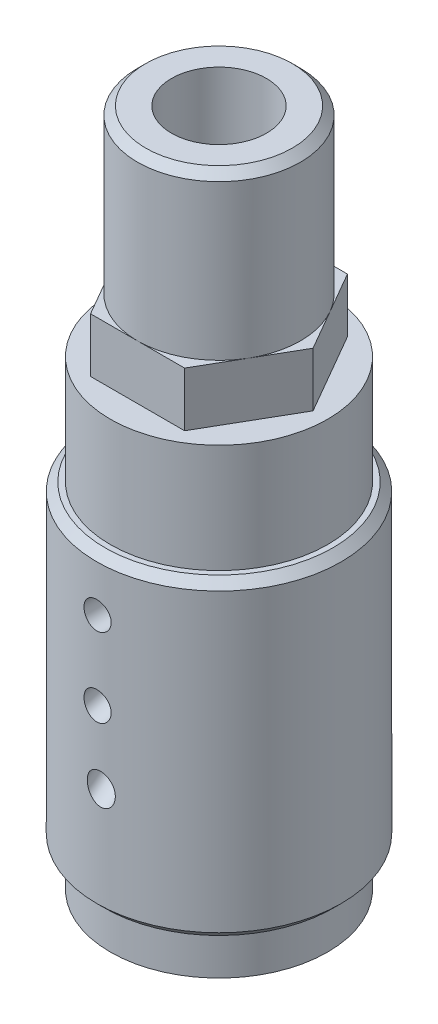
ISO-10303-21;
HEADER;
FILE_DESCRIPTION(('STEP AP214'),'2;1');
FILE_NAME('part.step','',(''),(''),'','','');
FILE_SCHEMA(('AUTOMOTIVE_DESIGN { 1 0 10303 214 1 1 1 1 }'));
ENDSEC;
DATA;
#1=APPLICATION_CONTEXT('core data for automotive mechanical design processes');
#2=APPLICATION_PROTOCOL_DEFINITION('international standard','automotive_design',2000,#1);
#3=PRODUCT_CONTEXT('',#1,'mechanical');
#4=PRODUCT('Part','Part','',(#3));
#5=PRODUCT_RELATED_PRODUCT_CATEGORY('part','',(#4));
#6=PRODUCT_DEFINITION_FORMATION('','',#4);
#7=PRODUCT_DEFINITION_CONTEXT('part definition',#1,'design');
#8=PRODUCT_DEFINITION('design','',#6,#7);
#9=PRODUCT_DEFINITION_SHAPE('','',#8);
#10=(LENGTH_UNIT() NAMED_UNIT(*) SI_UNIT(.MILLI.,.METRE.));
#11=(NAMED_UNIT(*) PLANE_ANGLE_UNIT() SI_UNIT($,.RADIAN.));
#12=(NAMED_UNIT(*) SI_UNIT($,.STERADIAN.) SOLID_ANGLE_UNIT());
#13=UNCERTAINTY_MEASURE_WITH_UNIT(LENGTH_MEASURE(1.E-05),#10,'distance_accuracy_value','');
#14=(GEOMETRIC_REPRESENTATION_CONTEXT(3) GLOBAL_UNCERTAINTY_ASSIGNED_CONTEXT((#13)) GLOBAL_UNIT_ASSIGNED_CONTEXT((#10,
#11,#12)) REPRESENTATION_CONTEXT('',''));
#15=CARTESIAN_POINT('',(0.,0.,0.));
#16=DIRECTION('',(0.,0.,1.));
#17=DIRECTION('',(1.,0.,0.));
#18=AXIS2_PLACEMENT_3D('',#15,#16,#17);
#19=CARTESIAN_POINT('',(0.,0.,0.));
#20=DIRECTION('',(0.,-1.,0.));
#21=DIRECTION('',(1.,0.,0.));
#22=AXIS2_PLACEMENT_3D('',#19,#20,#21);
#23=CYLINDRICAL_SURFACE('',#22,4.5);
#24=CARTESIAN_POINT('',(0.,1.80000000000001,0.));
#25=DIRECTION('',(0.,1.,0.));
#26=DIRECTION('',(-1.,0.,0.));
#27=AXIS2_PLACEMENT_3D('',#24,#25,#26);
#28=CIRCLE('',#27,4.5);
#29=CARTESIAN_POINT('',(-4.5,1.80000000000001,0.));
#30=VERTEX_POINT('',#29);
#31=EDGE_CURVE('E331',#30,#30,#28,.T.);
#32=ORIENTED_EDGE('',*,*,#31,.T.);
#33=EDGE_LOOP('',(#32));
#34=FACE_BOUND('',#33,.T.);
#35=CARTESIAN_POINT('',(0.,12.7,0.));
#36=DIRECTION('',(0.,-1.,0.));
#37=DIRECTION('',(1.,0.,0.));
#38=AXIS2_PLACEMENT_3D('',#35,#36,#37);
#39=CIRCLE('',#38,4.5);
#40=CARTESIAN_POINT('',(4.5,12.7,0.));
#41=VERTEX_POINT('',#40);
#42=EDGE_CURVE('E328',#41,#41,#39,.T.);
#43=ORIENTED_EDGE('',*,*,#42,.T.);
#44=EDGE_LOOP('',(#43));
#45=FACE_BOUND('',#44,.T.);
#46=CARTESIAN_POINT('',(0.,8.62935234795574,4.5));
#47=CARTESIAN_POINT('',(0.0277966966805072,8.62935118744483,4.49999964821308));
#48=CARTESIAN_POINT('',(0.0556119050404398,8.62701405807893,4.49973972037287));
#49=CARTESIAN_POINT('',(0.110472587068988,8.6177228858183,4.49872770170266));
#50=CARTESIAN_POINT('',(0.137517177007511,8.61076374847,4.49797506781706));
#51=CARTESIAN_POINT('',(0.19003469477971,8.59242572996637,4.49606238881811));
#52=CARTESIAN_POINT('',(0.215508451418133,8.58104920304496,4.49490256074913));
#53=CARTESIAN_POINT('',(0.264173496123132,8.55420220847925,4.49230530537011));
#54=CARTESIAN_POINT('',(0.287365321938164,8.53873270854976,4.49086794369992));
#55=CARTESIAN_POINT('',(0.330885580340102,8.50409970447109,4.48787171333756));
#56=CARTESIAN_POINT('',(0.351206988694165,8.48492740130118,4.4863125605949));
#57=CARTESIAN_POINT('',(0.38837603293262,8.4434658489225,4.4832480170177));
#58=CARTESIAN_POINT('',(0.405223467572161,8.42117641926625,4.48174262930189));
#59=CARTESIAN_POINT('',(0.435171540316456,8.37388184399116,4.4789345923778));
#60=CARTESIAN_POINT('',(0.448232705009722,8.34885159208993,4.47763413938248));
#61=CARTESIAN_POINT('',(0.470082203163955,8.29697796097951,4.47539315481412));
#62=CARTESIAN_POINT('',(0.478870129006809,8.27013440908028,4.47445265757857));
#63=CARTESIAN_POINT('',(0.492157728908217,8.21476811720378,4.47301094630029));
#64=CARTESIAN_POINT('',(0.4965583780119,8.18622138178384,4.47251989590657));
#65=CARTESIAN_POINT('',(0.500691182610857,8.12878860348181,4.47205909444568));
#66=CARTESIAN_POINT('',(0.500422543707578,8.09990250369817,4.47208943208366));
#67=CARTESIAN_POINT('',(0.495207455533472,8.04164340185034,4.472669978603));
#68=CARTESIAN_POINT('',(0.490113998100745,8.01228370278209,4.47323652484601));
#69=CARTESIAN_POINT('',(0.475211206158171,7.95479742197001,4.47484412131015));
#70=CARTESIAN_POINT('',(0.465400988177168,7.92667107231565,4.47588526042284));
#71=CARTESIAN_POINT('',(0.441039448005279,7.87178700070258,4.47835204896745));
#72=CARTESIAN_POINT('',(0.426384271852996,7.845075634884,4.47978599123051));
#73=CARTESIAN_POINT('',(0.392754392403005,7.79453222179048,4.48285936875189));
#74=CARTESIAN_POINT('',(0.373779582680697,7.77070024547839,4.48449880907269));
#75=CARTESIAN_POINT('',(0.332206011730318,7.7269493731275,4.48776870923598));
#76=CARTESIAN_POINT('',(0.309651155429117,7.70698886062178,4.48939905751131));
#77=CARTESIAN_POINT('',(0.261343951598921,7.67138436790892,4.49246960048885));
#78=CARTESIAN_POINT('',(0.235592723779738,7.6557388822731,4.49390986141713));
#79=CARTESIAN_POINT('',(0.183044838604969,7.63010898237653,4.49634845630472));
#80=CARTESIAN_POINT('',(0.156372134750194,7.61987254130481,4.49736587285));
#81=CARTESIAN_POINT('',(0.101617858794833,7.60431739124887,4.49893565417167));
#82=CARTESIAN_POINT('',(0.0735368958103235,7.59899657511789,4.49948821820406));
#83=CARTESIAN_POINT('',(0.0185232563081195,7.59367684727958,4.50004107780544));
#84=CARTESIAN_POINT('',(-0.00838126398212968,7.59338651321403,4.50007161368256));
#85=CARTESIAN_POINT('',(-0.0618395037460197,7.59739483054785,4.49965444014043));
#86=CARTESIAN_POINT('',(-0.0883932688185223,7.60169287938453,4.49920679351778));
#87=CARTESIAN_POINT('',(-0.139913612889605,7.61457783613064,4.49789697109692));
#88=CARTESIAN_POINT('',(-0.164900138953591,7.62308628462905,4.49704238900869));
#89=CARTESIAN_POINT('',(-0.21315252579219,7.64402852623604,4.49501389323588));
#90=CARTESIAN_POINT('',(-0.236418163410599,7.65646282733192,4.49383993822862));
#91=CARTESIAN_POINT('',(-0.28144234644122,7.68531804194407,4.49124888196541));
#92=CARTESIAN_POINT('',(-0.303122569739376,7.70186031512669,4.48982486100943));
#93=CARTESIAN_POINT('',(-0.34358998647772,7.73816201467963,4.48690967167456));
#94=CARTESIAN_POINT('',(-0.362376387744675,7.75792231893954,4.48541848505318));
#95=CARTESIAN_POINT('',(-0.397700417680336,7.80136267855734,4.48242876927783));
#96=CARTESIAN_POINT('',(-0.414037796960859,7.82520598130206,4.48093508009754));
#97=CARTESIAN_POINT('',(-0.442690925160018,7.87521194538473,4.47819522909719));
#98=CARTESIAN_POINT('',(-0.455005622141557,7.90137521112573,4.47694913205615));
#99=CARTESIAN_POINT('',(-0.475795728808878,7.95656316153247,4.47478863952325));
#100=CARTESIAN_POINT('',(-0.484072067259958,7.98566376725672,4.47389181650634));
#101=CARTESIAN_POINT('',(-0.495685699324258,8.04484831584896,4.47262005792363));
#102=CARTESIAN_POINT('',(-0.49902262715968,8.07493233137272,4.47224516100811));
#103=CARTESIAN_POINT('',(-0.500611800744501,8.13542600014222,4.4720676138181));
#104=CARTESIAN_POINT('',(-0.498832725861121,8.16583651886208,4.47226848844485));
#105=CARTESIAN_POINT('',(-0.490085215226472,8.22589452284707,4.47323548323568));
#106=CARTESIAN_POINT('',(-0.483117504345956,8.25554211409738,4.47400152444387));
#107=CARTESIAN_POINT('',(-0.464354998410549,8.3124077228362,4.47598707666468));
#108=CARTESIAN_POINT('',(-0.452689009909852,8.33966862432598,4.47719441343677));
#109=CARTESIAN_POINT('',(-0.424812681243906,8.39174073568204,4.47992514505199));
#110=CARTESIAN_POINT('',(-0.408603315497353,8.4165524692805,4.48144847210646));
#111=CARTESIAN_POINT('',(-0.372654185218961,8.46220838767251,4.484578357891));
#112=CARTESIAN_POINT('',(-0.353040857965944,8.48315247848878,4.4861808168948));
#113=CARTESIAN_POINT('',(-0.310501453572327,8.52136936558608,4.48932538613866));
#114=CARTESIAN_POINT('',(-0.287574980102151,8.53864172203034,4.49086748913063));
#115=CARTESIAN_POINT('',(-0.239546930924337,8.56869372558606,4.49368273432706));
#116=CARTESIAN_POINT('',(-0.214495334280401,8.58155297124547,4.49496045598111));
#117=CARTESIAN_POINT('',(-0.162584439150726,8.60284601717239,4.49713667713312));
#118=CARTESIAN_POINT('',(-0.135727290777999,8.61128497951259,4.49803561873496));
#119=CARTESIAN_POINT('',(-0.0905939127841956,8.62136919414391,4.49912331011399));
#120=CARTESIAN_POINT('',(-0.0726098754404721,8.62435894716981,4.4994505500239));
#121=CARTESIAN_POINT('',(-0.0364198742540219,8.62835090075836,4.49988900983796));
#122=CARTESIAN_POINT('',(-0.0182139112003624,8.62935310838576,4.50000023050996));
#123=CARTESIAN_POINT('',(0.,8.62935234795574,4.5));
#124=B_SPLINE_CURVE_WITH_KNOTS('',3,(#46,#47,#48,#49,#50,#51,#52,#53,#54,#55,#56,#57,#58,#59,
#60,#61,#62,#63,#64,#65,#66,#67,#68,#69,#70,#71,#72,#73,#74,#75,#76,#77,#78,#79,#80,#81,#82,#83,
#84,#85,#86,#87,#88,#89,#90,#91,#92,#93,#94,#95,#96,#97,#98,#99,#100,#101,#102,#103,#104,#105,
#106,#107,#108,#109,#110,#111,#112,#113,#114,#115,#116,#117,#118,#119,#120,#121,#122,#123),
.UNSPECIFIED.,.T.,.F.,(4,2,2,2,2,2,2,2,2,2,2,2,2,2,2,2,2,2,2,2,2,2,2,2,2,2,2,2,2,2,2,2,2,2,2,2,
2,2,4),(0.,0.0833236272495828,0.166739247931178,0.250110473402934,0.333462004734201,
0.417014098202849,0.500571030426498,0.58497009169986,0.669377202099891,0.755649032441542,
0.841935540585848,0.930938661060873,1.0199584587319,1.11102567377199,1.20209513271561,
1.29212357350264,1.38212056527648,1.46743868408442,1.55272021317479,1.63304360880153,
1.71335645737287,1.79222607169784,1.87110589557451,1.95267237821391,2.03426114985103,
2.12070334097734,2.20716811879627,2.2975476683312,2.38793391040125,2.47887468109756,
2.56980274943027,2.65839136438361,2.74696099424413,2.83275731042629,2.91856389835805,
3.00272958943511,3.08679677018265,3.14139514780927,3.19599333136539),.UNSPECIFIED.);
#125=CARTESIAN_POINT('',(0.,8.62935234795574,4.5));
#126=VERTEX_POINT('',#125);
#127=EDGE_CURVE('E300',#126,#126,#124,.T.);
#128=ORIENTED_EDGE('',*,*,#127,.T.);
#129=EDGE_LOOP('',(#128));
#130=FACE_BOUND('',#129,.T.);
#131=CARTESIAN_POINT('',(-0.5,11.,4.47213595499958));
#132=CARTESIAN_POINT('',(-0.499998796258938,11.0279920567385,4.47213631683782));
#133=CARTESIAN_POINT('',(-0.497641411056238,11.0560021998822,4.47240160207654));
#134=CARTESIAN_POINT('',(-0.488273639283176,11.1112446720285,4.47343382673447));
#135=CARTESIAN_POINT('',(-0.481258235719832,11.1384761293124,4.47420130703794));
#136=CARTESIAN_POINT('',(-0.462782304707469,11.1913533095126,4.47614994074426));
#137=CARTESIAN_POINT('',(-0.451324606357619,11.2170000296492,4.47733083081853));
#138=CARTESIAN_POINT('',(-0.424295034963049,11.2660012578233,4.47997290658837));
#139=CARTESIAN_POINT('',(-0.408723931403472,11.28935619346,4.48143403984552));
#140=CARTESIAN_POINT('',(-0.373835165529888,11.3332201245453,4.4844792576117));
#141=CARTESIAN_POINT('',(-0.354502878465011,11.3537174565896,4.48606380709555));
#142=CARTESIAN_POINT('',(-0.31267189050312,11.3911837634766,4.48917311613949));
#143=CARTESIAN_POINT('',(-0.290173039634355,11.4081525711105,4.49069787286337));
#144=CARTESIAN_POINT('',(-0.242575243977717,11.4381211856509,4.49352047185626));
#145=CARTESIAN_POINT('',(-0.217469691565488,11.4511105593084,4.49481771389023));
#146=CARTESIAN_POINT('',(-0.1654168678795,11.4726848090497,4.49703403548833));
#147=CARTESIAN_POINT('',(-0.138469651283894,11.4812698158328,4.49795312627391));
#148=CARTESIAN_POINT('',(-0.083617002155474,11.4937571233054,4.49930631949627));
#149=CARTESIAN_POINT('',(-0.0557160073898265,11.4976786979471,4.4997424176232));
#150=CARTESIAN_POINT('',(0.000351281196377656,11.5007874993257,4.50008728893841));
#151=CARTESIAN_POINT('',(0.0285175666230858,11.4999748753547,4.49999607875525));
#152=CARTESIAN_POINT('',(0.0841849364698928,11.4936539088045,4.4992982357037));
#153=CARTESIAN_POINT('',(0.11168840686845,11.4881662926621,4.49869387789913));
#154=CARTESIAN_POINT('',(0.165381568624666,11.4726834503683,4.49704023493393));
#155=CARTESIAN_POINT('',(0.191571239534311,11.4626881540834,4.49599094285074));
#156=CARTESIAN_POINT('',(0.24195821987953,11.4384512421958,4.49356144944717));
#157=CARTESIAN_POINT('',(0.266151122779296,11.4242005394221,4.49218054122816));
#158=CARTESIAN_POINT('',(0.311809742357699,11.3918639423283,4.48924257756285));
#159=CARTESIAN_POINT('',(0.333275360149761,11.3737779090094,4.4876855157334));
#160=CARTESIAN_POINT('',(0.372991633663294,11.3341676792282,4.48455985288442));
#161=CARTESIAN_POINT('',(0.391224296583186,11.312625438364,4.48299123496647));
#162=CARTESIAN_POINT('',(0.423817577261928,11.2667766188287,4.48002760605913));
#163=CARTESIAN_POINT('',(0.438178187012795,11.2424700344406,4.47863259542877));
#164=CARTESIAN_POINT('',(0.462620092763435,11.1917677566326,4.47617407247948));
#165=CARTESIAN_POINT('',(0.472700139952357,11.1653714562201,4.47511065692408));
#166=CARTESIAN_POINT('',(0.488279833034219,11.1112464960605,4.47343768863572));
#167=CARTESIAN_POINT('',(0.493779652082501,11.0835178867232,4.47282811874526));
#168=CARTESIAN_POINT('',(0.500019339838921,11.0276737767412,4.4721349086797));
#169=CARTESIAN_POINT('',(0.500784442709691,10.9995611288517,4.47204848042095));
#170=CARTESIAN_POINT('',(0.497599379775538,10.9436080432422,4.47240397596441));
#171=CARTESIAN_POINT('',(0.493649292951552,10.9157676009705,4.47284589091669));
#172=CARTESIAN_POINT('',(0.481167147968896,10.8612236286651,4.47420574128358));
#173=CARTESIAN_POINT('',(0.472647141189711,10.8345173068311,4.47512242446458));
#174=CARTESIAN_POINT('',(0.451279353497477,10.782912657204,4.47732751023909));
#175=CARTESIAN_POINT('',(0.438431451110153,10.7580143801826,4.47861592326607));
#176=CARTESIAN_POINT('',(0.408709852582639,10.7106179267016,4.48142601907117));
#177=CARTESIAN_POINT('',(0.391819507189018,10.6881302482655,4.48294865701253));
#178=CARTESIAN_POINT('',(0.354516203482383,10.6463000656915,4.48605256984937));
#179=CARTESIAN_POINT('',(0.334103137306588,10.6269576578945,4.48763384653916));
#180=CARTESIAN_POINT('',(0.290224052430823,10.5918793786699,4.49068534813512));
#181=CARTESIAN_POINT('',(0.266744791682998,10.5761600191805,4.49215504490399));
#182=CARTESIAN_POINT('',(0.217464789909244,10.5488879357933,4.49481002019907));
#183=CARTESIAN_POINT('',(0.191664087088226,10.5373351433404,4.49599530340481));
#184=CARTESIAN_POINT('',(0.138530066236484,10.5187518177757,4.49794553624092));
#185=CARTESIAN_POINT('',(0.111200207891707,10.5117114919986,4.49871139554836));
#186=CARTESIAN_POINT('',(0.0557373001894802,10.5023210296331,4.49974024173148));
#187=CARTESIAN_POINT('',(0.0276042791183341,10.4999707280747,4.50000324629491));
#188=CARTESIAN_POINT('',(-0.0285045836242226,10.5000296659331,4.49999670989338));
#189=CARTESIAN_POINT('',(-0.0564804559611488,10.5024133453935,4.49973002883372));
#190=CARTESIAN_POINT('',(-0.111631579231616,10.5118187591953,4.49869974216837));
#191=CARTESIAN_POINT('',(-0.138806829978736,10.5188404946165,4.49793613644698));
#192=CARTESIAN_POINT('',(-0.191583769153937,10.5373152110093,4.49599748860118));
#193=CARTESIAN_POINT('',(-0.217185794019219,10.5487672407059,4.49482253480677));
#194=CARTESIAN_POINT('',(-0.266108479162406,10.5757747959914,4.49219179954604));
#195=CARTESIAN_POINT('',(-0.289429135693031,10.5913303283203,4.49073601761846));
#196=CARTESIAN_POINT('',(-0.333257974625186,10.6261987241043,4.48769707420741));
#197=CARTESIAN_POINT('',(-0.353750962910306,10.6455306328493,4.48611329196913));
#198=CARTESIAN_POINT('',(-0.391212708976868,10.6873643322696,4.48300200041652));
#199=CARTESIAN_POINT('',(-0.408180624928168,10.7098668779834,4.48147450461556));
#200=CARTESIAN_POINT('',(-0.438153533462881,10.7574807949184,4.47864371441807));
#201=CARTESIAN_POINT('',(-0.451146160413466,10.7825999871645,4.47734112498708));
#202=CARTESIAN_POINT('',(-0.472711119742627,10.8346628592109,4.47511595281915));
#203=CARTESIAN_POINT('',(-0.481288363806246,10.8616044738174,4.47419294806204));
#204=CARTESIAN_POINT('',(-0.491675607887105,10.9072444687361,4.4730606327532));
#205=CARTESIAN_POINT('',(-0.494792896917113,10.9256525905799,4.47271555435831));
#206=CARTESIAN_POINT('',(-0.498955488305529,10.9627044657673,4.47225309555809));
#207=CARTESIAN_POINT('',(-0.500000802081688,10.9813482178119,4.47213571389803));
#208=CARTESIAN_POINT('',(-0.5,11.,4.47213595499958));
#209=B_SPLINE_CURVE_WITH_KNOTS('',3,(#131,#132,#133,#134,#135,#136,#137,#138,#139,#140,#141,
#142,#143,#144,#145,#146,#147,#148,#149,#150,#151,#152,#153,#154,#155,#156,#157,#158,#159,#160,
#161,#162,#163,#164,#165,#166,#167,#168,#169,#170,#171,#172,#173,#174,#175,#176,#177,#178,#179,
#180,#181,#182,#183,#184,#185,#186,#187,#188,#189,#190,#191,#192,#193,#194,#195,#196,#197,#198,
#199,#200,#201,#202,#203,#204,#205,#206,#207,#208),.UNSPECIFIED.,.T.,.F.,(4,2,2,2,2,2,2,2,2,2,2,
2,2,2,2,2,2,2,2,2,2,2,2,2,2,2,2,2,2,2,2,2,2,2,2,2,2,2,4),(0.,0.0839080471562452,
0.167906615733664,0.251851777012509,0.335781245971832,0.420043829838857,0.504310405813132,
0.588796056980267,0.673279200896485,0.757411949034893,0.841542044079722,0.925301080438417,
1.00906142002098,1.09300191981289,1.17694546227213,1.26134244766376,1.34573960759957,
1.4301613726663,1.51457994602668,1.59854821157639,1.68251507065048,1.76626158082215,
1.85001044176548,1.93411035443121,2.01821284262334,2.10269136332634,2.18716849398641,
2.27146167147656,2.35575188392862,2.43958822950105,2.5234245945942,2.60724296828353,
2.69106147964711,2.7753141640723,2.85958694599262,2.94411926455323,3.02855734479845,
3.08446760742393,3.14037756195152),.UNSPECIFIED.);
#210=CARTESIAN_POINT('',(-0.5,11.,4.47213595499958));
#211=VERTEX_POINT('',#210);
#212=EDGE_CURVE('E274',#211,#211,#209,.T.);
#213=ORIENTED_EDGE('',*,*,#212,.T.);
#214=EDGE_LOOP('',(#213));
#215=FACE_BOUND('',#214,.T.);
#216=CARTESIAN_POINT('',(0.108374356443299,6.08668994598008,4.49869481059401));
#217=CARTESIAN_POINT('',(0.135501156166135,6.0870470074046,4.49804098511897));
#218=CARTESIAN_POINT('',(0.162669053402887,6.08502800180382,4.49713856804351));
#219=CARTESIAN_POINT('',(0.216258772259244,6.07638915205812,4.49488087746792));
#220=CARTESIAN_POINT('',(0.242679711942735,6.06976408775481,4.49352509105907));
#221=CARTESIAN_POINT('',(0.293960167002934,6.05225111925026,4.49046164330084));
#222=CARTESIAN_POINT('',(0.318823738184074,6.04137487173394,4.48875495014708));
#223=CARTESIAN_POINT('',(0.366459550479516,6.01578894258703,4.4851175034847));
#224=CARTESIAN_POINT('',(0.389232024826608,6.00107968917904,4.48318677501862));
#225=CARTESIAN_POINT('',(0.433196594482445,5.96757956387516,4.47915734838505));
#226=CARTESIAN_POINT('',(0.454270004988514,5.94863370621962,4.47705500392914));
#227=CARTESIAN_POINT('',(0.493230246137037,5.90770582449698,4.4729306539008));
#228=CARTESIAN_POINT('',(0.511116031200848,5.88572280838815,4.47090867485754));
#229=CARTESIAN_POINT('',(0.544783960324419,5.83740627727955,4.46693654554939));
#230=CARTESIAN_POINT('',(0.560267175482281,5.81086295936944,4.46500637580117));
#231=CARTESIAN_POINT('',(0.586997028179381,5.75570021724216,4.46157106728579));
#232=CARTESIAN_POINT('',(0.59824199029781,5.72707997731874,4.46006609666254));
#233=CARTESIAN_POINT('',(0.617224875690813,5.66585086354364,4.45748071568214));
#234=CARTESIAN_POINT('',(0.62455840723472,5.6331143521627,4.45645041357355));
#235=CARTESIAN_POINT('',(0.634075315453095,5.56688591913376,4.45510619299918));
#236=CARTESIAN_POINT('',(0.636256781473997,5.53339372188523,4.45479254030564));
#237=CARTESIAN_POINT('',(0.635461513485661,5.46410904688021,4.45490625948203));
#238=CARTESIAN_POINT('',(0.632111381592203,5.42832037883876,4.45538727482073));
#239=CARTESIAN_POINT('',(0.619560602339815,5.35777598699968,4.45714980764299));
#240=CARTESIAN_POINT('',(0.610356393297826,5.32302090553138,4.45843181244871));
#241=CARTESIAN_POINT('',(0.586037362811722,5.25538060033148,4.46169385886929));
#242=CARTESIAN_POINT('',(0.570881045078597,5.22251040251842,4.46367879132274));
#243=CARTESIAN_POINT('',(0.534728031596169,5.16020018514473,4.46815352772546));
#244=CARTESIAN_POINT('',(0.51374072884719,5.13075475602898,4.47064251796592));
#245=CARTESIAN_POINT('',(0.47230888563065,5.08374119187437,4.4751802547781));
#246=CARTESIAN_POINT('',(0.453110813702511,5.06506535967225,4.47717776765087));
#247=CARTESIAN_POINT('',(0.411879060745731,5.03114706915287,4.48115871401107));
#248=CARTESIAN_POINT('',(0.389847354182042,5.01590224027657,4.48314215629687));
#249=CARTESIAN_POINT('',(0.343247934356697,4.98949321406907,4.48695100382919));
#250=CARTESIAN_POINT('',(0.318665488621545,4.97835463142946,4.48877536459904));
#251=CARTESIAN_POINT('',(0.267811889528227,4.96093947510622,4.49209565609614));
#252=CARTESIAN_POINT('',(0.241541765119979,4.95465996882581,4.49359178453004));
#253=CARTESIAN_POINT('',(0.191128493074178,4.94770222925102,4.4960024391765));
#254=CARTESIAN_POINT('',(0.167058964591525,4.94649601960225,4.4969621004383));
#255=CARTESIAN_POINT('',(0.119061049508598,4.94821468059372,4.49848871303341));
#256=CARTESIAN_POINT('',(0.0951326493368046,4.95113914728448,4.499055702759));
#257=CARTESIAN_POINT('',(0.0484990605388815,4.96078231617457,4.49979811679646));
#258=CARTESIAN_POINT('',(0.025779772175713,4.96743350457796,4.49998024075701));
#259=CARTESIAN_POINT('',(-0.0183852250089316,4.98409240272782,4.50001672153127));
#260=CARTESIAN_POINT('',(-0.0398305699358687,4.99410106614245,4.49987098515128));
#261=CARTESIAN_POINT('',(-0.0831932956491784,5.01819859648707,4.49928839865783));
#262=CARTESIAN_POINT('',(-0.104936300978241,5.03259920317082,4.49882341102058));
#263=CARTESIAN_POINT('',(-0.146139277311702,5.06434622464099,4.49767374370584));
#264=CARTESIAN_POINT('',(-0.165597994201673,5.0816942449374,4.496988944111));
#265=CARTESIAN_POINT('',(-0.205071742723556,5.12189125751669,4.49537521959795));
#266=CARTESIAN_POINT('',(-0.224642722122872,5.14517536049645,4.49442463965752));
#267=CARTESIAN_POINT('',(-0.260236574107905,5.19431093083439,4.49250431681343));
#268=CARTESIAN_POINT('',(-0.276257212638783,5.22016399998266,4.49153456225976));
#269=CARTESIAN_POINT('',(-0.306842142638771,5.27807411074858,4.48955671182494));
#270=CARTESIAN_POINT('',(-0.320776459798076,5.31046600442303,4.48856676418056));
#271=CARTESIAN_POINT('',(-0.343447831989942,5.37703987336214,4.48688899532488));
#272=CARTESIAN_POINT('',(-0.352181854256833,5.41122288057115,4.48620135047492));
#273=CARTESIAN_POINT('',(-0.364591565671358,5.48304952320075,4.48521081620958));
#274=CARTESIAN_POINT('',(-0.367859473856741,5.52076550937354,4.48493906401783));
#275=CARTESIAN_POINT('',(-0.367685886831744,5.59620136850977,4.48495352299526));
#276=CARTESIAN_POINT('',(-0.364245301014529,5.63392124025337,4.48523965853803));
#277=CARTESIAN_POINT('',(-0.350658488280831,5.70611345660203,4.48632167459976));
#278=CARTESIAN_POINT('',(-0.340870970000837,5.74065260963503,4.48709022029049));
#279=CARTESIAN_POINT('',(-0.314793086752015,5.80717785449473,4.48899493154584));
#280=CARTESIAN_POINT('',(-0.298509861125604,5.83916670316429,4.49013069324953));
#281=CARTESIAN_POINT('',(-0.262153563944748,5.89520170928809,4.49238919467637));
#282=CARTESIAN_POINT('',(-0.242838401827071,5.91974022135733,4.49349478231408));
#283=CARTESIAN_POINT('',(-0.199860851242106,5.96467356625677,4.49561070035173));
#284=CARTESIAN_POINT('',(-0.176201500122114,5.98507127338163,4.49662109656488));
#285=CARTESIAN_POINT('',(-0.128277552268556,6.01869724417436,4.49822750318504));
#286=CARTESIAN_POINT('',(-0.104403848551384,6.03248361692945,4.49885805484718));
#287=CARTESIAN_POINT('',(-0.0545926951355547,6.0555755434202,4.49973739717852));
#288=CARTESIAN_POINT('',(-0.0286579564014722,6.06488687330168,4.49998668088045));
#289=CARTESIAN_POINT('',(0.0159114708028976,6.07651275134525,4.50000821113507));
#290=CARTESIAN_POINT('',(0.0342218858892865,6.08011329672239,4.4999077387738));
#291=CARTESIAN_POINT('',(0.0711398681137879,6.08507925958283,4.4994755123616));
#292=CARTESIAN_POINT('',(0.0897474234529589,6.08644476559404,4.49914376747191));
#293=CARTESIAN_POINT('',(0.108374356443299,6.08668994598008,4.49869481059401));
#294=B_SPLINE_CURVE_WITH_KNOTS('',3,(#216,#217,#218,#219,#220,#221,#222,#223,#224,#225,#226,
#227,#228,#229,#230,#231,#232,#233,#234,#235,#236,#237,#238,#239,#240,#241,#242,#243,#244,#245,
#246,#247,#248,#249,#250,#251,#252,#253,#254,#255,#256,#257,#258,#259,#260,#261,#262,#263,#264,
#265,#266,#267,#268,#269,#270,#271,#272,#273,#274,#275,#276,#277,#278,#279,#280,#281,#282,#283,
#284,#285,#286,#287,#288,#289,#290,#291,#292,#293),.UNSPECIFIED.,.T.,.F.,(4,2,2,2,2,2,2,2,2,2,2,
2,2,2,2,2,2,2,2,2,2,2,2,2,2,2,2,2,2,2,2,2,2,2,2,2,2,2,4),(0.,0.0813388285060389,
0.162769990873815,0.243979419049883,0.325179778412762,0.410066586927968,0.494981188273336,
0.586962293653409,0.678979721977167,0.779239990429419,0.879537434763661,0.986885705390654,
1.09429935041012,1.2024755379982,1.31047846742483,1.39072708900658,1.47092009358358,
1.55160519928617,1.63224157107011,1.70423973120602,1.77623085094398,1.84695807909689,
1.91770541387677,1.99565819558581,2.07365357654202,2.16459878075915,2.25560105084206,
2.36098073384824,2.46642181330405,2.57942632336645,2.69241551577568,2.79951788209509,
2.90650285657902,2.99971288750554,3.09285799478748,3.17516279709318,3.25736107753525,
3.31321554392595,3.36906779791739),.UNSPECIFIED.);
#295=CARTESIAN_POINT('',(0.108374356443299,6.08668994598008,4.49869481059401));
#296=VERTEX_POINT('',#295);
#297=EDGE_CURVE('E306',#296,#296,#294,.T.);
#298=ORIENTED_EDGE('',*,*,#297,.T.);
#299=EDGE_LOOP('',(#298));
#300=FACE_BOUND('',#299,.T.);
#301=ADVANCED_FACE('F37',(#34,#45,#130,#215,#300),#23,.T.);
#302=CARTESIAN_POINT('',(0.,5.,0.));
#303=DIRECTION('',(0.,1.,0.));
#304=DIRECTION('',(-1.,0.,0.));
#305=AXIS2_PLACEMENT_3D('',#302,#303,#304);
#306=CYLINDRICAL_SURFACE('',#305,1.75);
#307=CARTESIAN_POINT('',(0.,9.36621262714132,1.75));
#308=CARTESIAN_POINT('',(0.0280979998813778,9.36621208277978,1.74999952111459));
#309=CARTESIAN_POINT('',(0.0562035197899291,9.36393682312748,1.74931690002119));
#310=CARTESIAN_POINT('',(0.111625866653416,9.35488293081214,1.74665696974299));
#311=CARTESIAN_POINT('',(0.138942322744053,9.34810221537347,1.74467906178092));
#312=CARTESIAN_POINT('',(0.191999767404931,9.3301881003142,1.73963971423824));
#313=CARTESIAN_POINT('',(0.217740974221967,9.31905530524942,1.7365784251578));
#314=CARTESIAN_POINT('',(0.266917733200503,9.29268820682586,1.72970285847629));
#315=CARTESIAN_POINT('',(0.290353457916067,9.27745421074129,1.72588863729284));
#316=CARTESIAN_POINT('',(0.334203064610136,9.24327655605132,1.7179361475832));
#317=CARTESIAN_POINT('',(0.354623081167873,9.22434061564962,1.71379856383));
#318=CARTESIAN_POINT('',(0.391903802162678,9.18321588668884,1.70566010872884));
#319=CARTESIAN_POINT('',(0.408765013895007,9.16102756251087,1.701659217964));
#320=CARTESIAN_POINT('',(0.438229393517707,9.11435157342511,1.69430905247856));
#321=CARTESIAN_POINT('',(0.450891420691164,9.08990243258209,1.6909510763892));
#322=CARTESIAN_POINT('',(0.471975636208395,9.0391392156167,1.6851881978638));
#323=CARTESIAN_POINT('',(0.48039831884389,9.01282535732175,1.68278318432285));
#324=CARTESIAN_POINT('',(0.492808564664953,8.95935013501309,1.6791906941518));
#325=CARTESIAN_POINT('',(0.49683557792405,8.93219859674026,1.67799239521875));
#326=CARTESIAN_POINT('',(0.500624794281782,8.87757726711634,1.67686569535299));
#327=CARTESIAN_POINT('',(0.500386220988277,8.85010741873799,1.67693752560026));
#328=CARTESIAN_POINT('',(0.495719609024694,8.79454314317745,1.67832299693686));
#329=CARTESIAN_POINT('',(0.49113753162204,8.76646299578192,1.67968229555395));
#330=CARTESIAN_POINT('',(0.477818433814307,8.71138630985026,1.68351920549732));
#331=CARTESIAN_POINT('',(0.469079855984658,8.68439018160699,1.68599723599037));
#332=CARTESIAN_POINT('',(0.446909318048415,8.63008428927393,1.69201468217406));
#333=CARTESIAN_POINT('',(0.433171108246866,8.60290664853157,1.69562045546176));
#334=CARTESIAN_POINT('',(0.401527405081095,8.55116822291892,1.70339092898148));
#335=CARTESIAN_POINT('',(0.383619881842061,8.52660872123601,1.70755590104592));
#336=CARTESIAN_POINT('',(0.34320635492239,8.47993404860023,1.71614446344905));
#337=CARTESIAN_POINT('',(0.320550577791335,8.45794841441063,1.72057185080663));
#338=CARTESIAN_POINT('',(0.271556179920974,8.41843095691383,1.72898023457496));
#339=CARTESIAN_POINT('',(0.24521942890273,8.40089688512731,1.73296145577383));
#340=CARTESIAN_POINT('',(0.191510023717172,8.37225175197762,1.73968471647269));
#341=CARTESIAN_POINT('',(0.164342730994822,8.3607738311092,1.74249453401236));
#342=CARTESIAN_POINT('',(0.108241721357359,8.34315154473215,1.74687471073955));
#343=CARTESIAN_POINT('',(0.0793100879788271,8.33700101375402,1.74844650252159));
#344=CARTESIAN_POINT('',(0.0243932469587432,8.33085835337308,1.75001862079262));
#345=CARTESIAN_POINT('',(-0.00151396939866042,8.33019880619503,1.75018921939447));
#346=CARTESIAN_POINT('',(-0.05303651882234,8.33332951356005,1.74938564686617));
#347=CARTESIAN_POINT('',(-0.0786519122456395,8.33711883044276,1.74841171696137));
#348=CARTESIAN_POINT('',(-0.127644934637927,8.34865315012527,1.74550339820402));
#349=CARTESIAN_POINT('',(-0.151071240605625,8.35620625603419,1.74361571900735));
#350=CARTESIAN_POINT('',(-0.19640756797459,8.37481018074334,1.73909277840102));
#351=CARTESIAN_POINT('',(-0.21831727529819,8.38586172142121,1.73645736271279));
#352=CARTESIAN_POINT('',(-0.261630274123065,8.41190010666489,1.73047968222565));
#353=CARTESIAN_POINT('',(-0.282898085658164,8.42710326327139,1.72710156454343));
#354=CARTESIAN_POINT('',(-0.322883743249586,8.46050210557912,1.72007530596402));
#355=CARTESIAN_POINT('',(-0.341600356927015,8.47869922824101,1.71642703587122));
#356=CARTESIAN_POINT('',(-0.378282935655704,8.51991452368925,1.70874048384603));
#357=CARTESIAN_POINT('',(-0.395895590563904,8.54324861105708,1.70470735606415));
#358=CARTESIAN_POINT('',(-0.427306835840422,8.592433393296,1.69710653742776));
#359=CARTESIAN_POINT('',(-0.441103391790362,8.61828542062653,1.6935390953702));
#360=CARTESIAN_POINT('',(-0.465471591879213,8.67393181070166,1.68701156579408));
#361=CARTESIAN_POINT('',(-0.47572041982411,8.70387646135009,1.68411781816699));
#362=CARTESIAN_POINT('',(-0.491066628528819,8.76516116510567,1.67970780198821));
#363=CARTESIAN_POINT('',(-0.496164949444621,8.79650096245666,1.67819128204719));
#364=CARTESIAN_POINT('',(-0.500789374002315,8.85875473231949,1.67681722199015));
#365=CARTESIAN_POINT('',(-0.500467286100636,8.88965611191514,1.67691448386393));
#366=CARTESIAN_POINT('',(-0.494406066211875,8.95087395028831,1.67871169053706));
#367=CARTESIAN_POINT('',(-0.488670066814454,8.98119073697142,1.68041070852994));
#368=CARTESIAN_POINT('',(-0.472455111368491,9.03787484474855,1.68503712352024));
#369=CARTESIAN_POINT('',(-0.462377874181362,9.06436620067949,1.68785919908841));
#370=CARTESIAN_POINT('',(-0.437847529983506,9.11511900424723,1.69438772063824));
#371=CARTESIAN_POINT('',(-0.423395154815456,9.13938082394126,1.69809401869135));
#372=CARTESIAN_POINT('',(-0.391096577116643,9.1841578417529,1.70581603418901));
#373=CARTESIAN_POINT('',(-0.373386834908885,9.20477443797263,1.70981638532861));
#374=CARTESIAN_POINT('',(-0.334755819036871,9.24274737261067,1.71779706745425));
#375=CARTESIAN_POINT('',(-0.313834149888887,9.26010330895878,1.7217773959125));
#376=CARTESIAN_POINT('',(-0.269100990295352,9.29132608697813,1.72933643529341));
#377=CARTESIAN_POINT('',(-0.245258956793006,9.30515038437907,1.73290998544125));
#378=CARTESIAN_POINT('',(-0.195548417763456,9.32873203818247,1.73922032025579));
#379=CARTESIAN_POINT('',(-0.169680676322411,9.3384909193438,1.741957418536));
#380=CARTESIAN_POINT('',(-0.119971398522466,9.35277719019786,1.74603808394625));
#381=CARTESIAN_POINT('',(-0.0962837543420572,9.3578078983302,1.74751354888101));
#382=CARTESIAN_POINT('',(-0.0483992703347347,9.3645258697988,1.74949471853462));
#383=CARTESIAN_POINT('',(-0.0242024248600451,9.36621309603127,1.75000041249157));
#384=CARTESIAN_POINT('',(0.,9.36621262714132,1.75));
#385=B_SPLINE_CURVE_WITH_KNOTS('',3,(#307,#308,#309,#310,#311,#312,#313,#314,#315,#316,#317,
#318,#319,#320,#321,#322,#323,#324,#325,#326,#327,#328,#329,#330,#331,#332,#333,#334,#335,#336,
#337,#338,#339,#340,#341,#342,#343,#344,#345,#346,#347,#348,#349,#350,#351,#352,#353,#354,#355,
#356,#357,#358,#359,#360,#361,#362,#363,#364,#365,#366,#367,#368,#369,#370,#371,#372,#373,#374,
#375,#376,#377,#378,#379,#380,#381,#382,#383,#384),.UNSPECIFIED.,.T.,.F.,(4,2,2,2,2,2,2,2,2,2,2,
2,2,2,2,2,2,2,2,2,2,2,2,2,2,2,2,2,2,2,2,2,2,2,2,2,2,2,4),(0.,0.0842075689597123,
0.168454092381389,0.25268891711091,0.336917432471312,0.420972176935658,0.505014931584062,
0.587824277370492,0.67062396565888,0.752674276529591,0.834739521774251,0.919828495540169,
1.00494937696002,1.09654011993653,1.18817554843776,1.28331834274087,1.37841298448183,
1.46677486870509,1.55503435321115,1.63238114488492,1.70971163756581,1.78345049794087,
1.85720458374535,1.93596830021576,2.01476993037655,2.10293284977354,2.19114267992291,
2.28602384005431,2.38088767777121,2.47309921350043,2.56525742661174,2.65027848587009,
2.73528533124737,2.81731747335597,2.89935972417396,2.9823480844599,3.06530529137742,
3.13783731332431,3.21037014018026),.UNSPECIFIED.);
#386=CARTESIAN_POINT('',(0.,9.36621262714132,1.75));
#387=VERTEX_POINT('',#386);
#388=EDGE_CURVE('E275',#387,#387,#385,.T.);
#389=ORIENTED_EDGE('',*,*,#388,.F.);
#390=EDGE_LOOP('',(#389));
#391=FACE_BOUND('',#390,.T.);
#392=CARTESIAN_POINT('',(0.,25.,0.));
#393=DIRECTION('',(0.,1.,0.));
#394=DIRECTION('',(-1.,0.,0.));
#395=AXIS2_PLACEMENT_3D('',#392,#393,#394);
#396=CIRCLE('',#395,1.75);
#397=CARTESIAN_POINT('',(-1.75,25.,0.));
#398=VERTEX_POINT('',#397);
#399=EDGE_CURVE('E230',#398,#398,#396,.T.);
#400=ORIENTED_EDGE('',*,*,#399,.T.);
#401=EDGE_LOOP('',(#400));
#402=FACE_BOUND('',#401,.T.);
#403=CARTESIAN_POINT('',(0.,5.,0.));
#404=DIRECTION('',(0.,1.,0.));
#405=DIRECTION('',(-1.,0.,0.));
#406=AXIS2_PLACEMENT_3D('',#403,#404,#405);
#407=CIRCLE('',#406,1.75);
#408=CARTESIAN_POINT('',(-0.5,5.,1.67705098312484));
#409=VERTEX_POINT('',#408);
#410=CARTESIAN_POINT('',(0.5,5.,1.67705098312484));
#411=VERTEX_POINT('',#410);
#412=EDGE_CURVE('E151',#409,#411,#407,.T.);
#413=ORIENTED_EDGE('',*,*,#412,.F.);
#414=CARTESIAN_POINT('',(-0.5,5.,-1.67705098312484));
#415=VERTEX_POINT('',#414);
#416=EDGE_CURVE('E248',#415,#409,#407,.T.);
#417=ORIENTED_EDGE('',*,*,#416,.F.);
#418=CARTESIAN_POINT('',(0.5,5.,-1.67705098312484));
#419=VERTEX_POINT('',#418);
#420=EDGE_CURVE('E429',#419,#415,#407,.T.);
#421=ORIENTED_EDGE('',*,*,#420,.F.);
#422=EDGE_CURVE('E247',#411,#419,#407,.T.);
#423=ORIENTED_EDGE('',*,*,#422,.F.);
#424=EDGE_LOOP('',(#413,#417,#421,#423));
#425=FACE_BOUND('',#424,.T.);
#426=CARTESIAN_POINT('',(-0.5,11.,1.67705098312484));
#427=CARTESIAN_POINT('',(-0.499999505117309,11.0274628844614,1.6770513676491));
#428=CARTESIAN_POINT('',(-0.497729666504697,11.0549307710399,1.67773294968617));
#429=CARTESIAN_POINT('',(-0.488730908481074,11.1090678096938,1.68037597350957));
#430=CARTESIAN_POINT('',(-0.48200017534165,11.1357366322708,1.68233793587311));
#431=CARTESIAN_POINT('',(-0.464323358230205,11.1874843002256,1.68730177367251));
#432=CARTESIAN_POINT('',(-0.45338380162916,11.2125655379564,1.69030203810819));
#433=CARTESIAN_POINT('',(-0.427620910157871,11.2605419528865,1.6970023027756));
#434=CARTESIAN_POINT('',(-0.41279711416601,11.2834368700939,1.70070238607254));
#435=CARTESIAN_POINT('',(-0.379231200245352,11.3270478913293,1.70850445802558));
#436=CARTESIAN_POINT('',(-0.360397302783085,11.3476919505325,1.71261438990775));
#437=CARTESIAN_POINT('',(-0.319542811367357,11.3855756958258,1.72070491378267));
#438=CARTESIAN_POINT('',(-0.297521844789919,11.4028149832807,1.72468549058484));
#439=CARTESIAN_POINT('',(-0.250411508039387,11.4337071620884,1.73215833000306));
#440=CARTESIAN_POINT('',(-0.225272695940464,11.4472874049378,1.73564013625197));
#441=CARTESIAN_POINT('',(-0.172952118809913,11.470000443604,1.74163135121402));
#442=CARTESIAN_POINT('',(-0.145770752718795,11.4791341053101,1.74414094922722));
#443=CARTESIAN_POINT('',(-0.0908896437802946,11.4924586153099,1.74784879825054));
#444=CARTESIAN_POINT('',(-0.0632219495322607,11.4967722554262,1.74907956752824));
#445=CARTESIAN_POINT('',(-0.00753002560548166,11.5007216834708,1.75020523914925));
#446=CARTESIAN_POINT('',(0.0204941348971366,11.5003583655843,1.75010039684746));
#447=CARTESIAN_POINT('',(0.0752450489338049,11.4950484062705,1.74859001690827));
#448=CARTESIAN_POINT('',(0.101985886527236,11.4902345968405,1.74722217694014));
#449=CARTESIAN_POINT('',(0.154263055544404,11.4763762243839,1.74338471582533));
#450=CARTESIAN_POINT('',(0.179799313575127,11.4673314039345,1.74091502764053));
#451=CARTESIAN_POINT('',(0.229268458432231,11.445172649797,1.73509757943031));
#452=CARTESIAN_POINT('',(0.253180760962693,11.4320153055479,1.73174051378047));
#453=CARTESIAN_POINT('',(0.298501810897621,11.4020388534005,1.72450692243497));
#454=CARTESIAN_POINT('',(0.319910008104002,11.3852189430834,1.72063028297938));
#455=CARTESIAN_POINT('',(0.360408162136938,11.3476985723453,1.71261420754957));
#456=CARTESIAN_POINT('',(0.379390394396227,11.3268826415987,1.7084703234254));
#457=CARTESIAN_POINT('',(0.413623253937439,11.2823212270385,1.70050743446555));
#458=CARTESIAN_POINT('',(0.428873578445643,11.2585755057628,1.6966884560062));
#459=CARTESIAN_POINT('',(0.455308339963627,11.2085672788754,1.68978793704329));
#460=CARTESIAN_POINT('',(0.466459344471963,11.1822861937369,1.68671252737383));
#461=CARTESIAN_POINT('',(0.48414737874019,11.1281117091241,1.68172136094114));
#462=CARTESIAN_POINT('',(0.490685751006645,11.1002187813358,1.67980526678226));
#463=CARTESIAN_POINT('',(0.498768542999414,11.0446298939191,1.67742278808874));
#464=CARTESIAN_POINT('',(0.50047537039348,11.0169595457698,1.67690927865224));
#465=CARTESIAN_POINT('',(0.499297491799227,10.9617279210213,1.67726039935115));
#466=CARTESIAN_POINT('',(0.496413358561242,10.9341666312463,1.67812485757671));
#467=CARTESIAN_POINT('',(0.486279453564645,10.8805896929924,1.68108857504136));
#468=CARTESIAN_POINT('',(0.479131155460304,10.8545531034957,1.6831591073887));
#469=CARTESIAN_POINT('',(0.460787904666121,10.8040495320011,1.68827265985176));
#470=CARTESIAN_POINT('',(0.449592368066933,10.7795827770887,1.69131582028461));
#471=CARTESIAN_POINT('',(0.423154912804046,10.7322444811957,1.69812547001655));
#472=CARTESIAN_POINT('',(0.407819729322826,10.7094273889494,1.70190799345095));
#473=CARTESIAN_POINT('',(0.373651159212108,10.6666309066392,1.70973431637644));
#474=CARTESIAN_POINT('',(0.354817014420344,10.646652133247,1.71377817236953));
#475=CARTESIAN_POINT('',(0.313427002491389,10.6094051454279,1.72183681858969));
#476=CARTESIAN_POINT('',(0.290766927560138,10.5922512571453,1.72584601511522));
#477=CARTESIAN_POINT('',(0.242796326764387,10.5619885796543,1.73324494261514));
#478=CARTESIAN_POINT('',(0.217485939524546,10.5488795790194,1.73663470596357));
#479=CARTESIAN_POINT('',(0.165108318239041,10.5272039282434,1.74239126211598));
#480=CARTESIAN_POINT('',(0.138056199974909,10.5186029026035,1.74476577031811));
#481=CARTESIAN_POINT('',(0.0828114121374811,10.506093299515,1.74825834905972));
#482=CARTESIAN_POINT('',(0.0546190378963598,10.5021835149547,1.74937674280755));
#483=CARTESIAN_POINT('',(-0.00104455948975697,10.4992521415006,1.75021333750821));
#484=CARTESIAN_POINT('',(-0.0285064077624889,10.5000639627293,1.74997925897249));
#485=CARTESIAN_POINT('',(-0.0828862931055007,10.5061595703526,1.74824767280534));
#486=CARTESIAN_POINT('',(-0.109804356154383,10.5114431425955,1.74675022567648));
#487=CARTESIAN_POINT('',(-0.162101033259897,10.5262328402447,1.74267200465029));
#488=CARTESIAN_POINT('',(-0.187491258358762,10.535700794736,1.74010103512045));
#489=CARTESIAN_POINT('',(-0.236336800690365,10.5585565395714,1.73414273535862));
#490=CARTESIAN_POINT('',(-0.25979181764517,10.5719449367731,1.73075527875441));
#491=CARTESIAN_POINT('',(-0.304858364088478,10.6027243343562,1.72339738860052));
#492=CARTESIAN_POINT('',(-0.32639433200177,10.6202225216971,1.71941261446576));
#493=CARTESIAN_POINT('',(-0.366280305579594,10.6585272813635,1.71136016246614));
#494=CARTESIAN_POINT('',(-0.384629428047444,10.6793347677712,1.7072924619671));
#495=CARTESIAN_POINT('',(-0.418102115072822,10.7243242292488,1.69941009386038));
#496=CARTESIAN_POINT('',(-0.433128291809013,10.7485804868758,1.69560487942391));
#497=CARTESIAN_POINT('',(-0.45886985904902,10.7993804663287,1.68882111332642));
#498=CARTESIAN_POINT('',(-0.469587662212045,10.8259228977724,1.68584209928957));
#499=CARTESIAN_POINT('',(-0.485246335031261,10.8769134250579,1.68139614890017));
#500=CARTESIAN_POINT('',(-0.490764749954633,10.9011725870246,1.6797810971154));
#501=CARTESIAN_POINT('',(-0.498141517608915,10.950286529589,1.67760842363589));
#502=CARTESIAN_POINT('',(-0.500000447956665,10.9751412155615,1.67705063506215));
#503=CARTESIAN_POINT('',(-0.5,11.,1.67705098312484));
#504=B_SPLINE_CURVE_WITH_KNOTS('',3,(#426,#427,#428,#429,#430,#431,#432,#433,#434,#435,#436,
#437,#438,#439,#440,#441,#442,#443,#444,#445,#446,#447,#448,#449,#450,#451,#452,#453,#454,#455,
#456,#457,#458,#459,#460,#461,#462,#463,#464,#465,#466,#467,#468,#469,#470,#471,#472,#473,#474,
#475,#476,#477,#478,#479,#480,#481,#482,#483,#484,#485,#486,#487,#488,#489,#490,#491,#492,#493,
#494,#495,#496,#497,#498,#499,#500,#501,#502,#503),.UNSPECIFIED.,.T.,.F.,(4,2,2,2,2,2,2,2,2,2,2,
2,2,2,2,2,2,2,2,2,2,2,2,2,2,2,2,2,2,2,2,2,2,2,2,2,2,2,4),(0.,0.0822970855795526,
0.164627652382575,0.246831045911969,0.329044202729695,0.413392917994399,0.497751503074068,
0.583678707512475,0.669589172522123,0.753257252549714,0.836909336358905,0.918142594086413,
0.999380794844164,1.08150725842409,1.16365173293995,1.24867903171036,1.33371322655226,
1.41942630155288,1.50511441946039,1.58788590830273,1.67064707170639,1.75151322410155,
1.83239104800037,1.91527001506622,1.99816696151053,2.08386347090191,2.16955550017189,
2.25458421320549,2.33959104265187,2.42161724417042,2.50363951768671,2.5849285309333,
2.66623013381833,2.7499494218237,2.83369187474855,2.91963403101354,3.0055279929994,
3.0800332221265,3.15452669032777),.UNSPECIFIED.);
#505=CARTESIAN_POINT('',(-0.5,11.,1.67705098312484));
#506=VERTEX_POINT('',#505);
#507=EDGE_CURVE('E178',#506,#506,#504,.T.);
#508=ORIENTED_EDGE('',*,*,#507,.F.);
#509=EDGE_LOOP('',(#508));
#510=FACE_BOUND('',#509,.T.);
#511=CARTESIAN_POINT('',(-0.227200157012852,7.6021452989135,1.73518877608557));
#512=CARTESIAN_POINT('',(-0.197276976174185,7.59999530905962,1.73910544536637));
#513=CARTESIAN_POINT('',(-0.167378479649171,7.59533977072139,1.74222529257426));
#514=CARTESIAN_POINT('',(-0.108556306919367,7.58122012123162,1.74688061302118));
#515=CARTESIAN_POINT('',(-0.0796356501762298,7.57174235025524,1.74841154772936));
#516=CARTESIAN_POINT('',(-0.023713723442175,7.54829411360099,1.75006225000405));
#517=CARTESIAN_POINT('',(0.00329203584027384,7.53433461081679,1.75018543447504));
#518=CARTESIAN_POINT('',(0.0546982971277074,7.50231375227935,1.74933412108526));
#519=CARTESIAN_POINT('',(0.0791005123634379,7.48425511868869,1.74836035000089));
#520=CARTESIAN_POINT('',(0.125349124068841,7.44394855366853,1.74566323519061));
#521=CARTESIAN_POINT('',(0.147103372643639,7.42159630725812,1.74391941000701));
#522=CARTESIAN_POINT('',(0.186703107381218,7.37368410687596,1.74012611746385));
#523=CARTESIAN_POINT('',(0.204547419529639,7.34812319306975,1.73807655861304));
#524=CARTESIAN_POINT('',(0.236581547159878,7.29346099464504,1.73401297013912));
#525=CARTESIAN_POINT('',(0.250603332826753,7.26426101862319,1.73200338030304));
#526=CARTESIAN_POINT('',(0.27384761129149,7.20398678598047,1.72848086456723));
#527=CARTESIAN_POINT('',(0.283069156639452,7.1729121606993,1.7269680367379));
#528=CARTESIAN_POINT('',(0.297034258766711,7.10798019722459,1.72462293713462));
#529=CARTESIAN_POINT('',(0.301507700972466,7.07406335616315,1.72383204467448));
#530=CARTESIAN_POINT('',(0.305118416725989,7.00592654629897,1.72319634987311));
#531=CARTESIAN_POINT('',(0.304252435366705,6.97170640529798,1.72335212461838));
#532=CARTESIAN_POINT('',(0.297053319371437,6.90187628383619,1.72460835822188));
#533=CARTESIAN_POINT('',(0.29040997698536,6.86629891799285,1.72576239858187));
#534=CARTESIAN_POINT('',(0.271264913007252,6.79678156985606,1.72887525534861));
#535=CARTESIAN_POINT('',(0.258765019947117,6.76284108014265,1.73083382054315));
#536=CARTESIAN_POINT('',(0.23065083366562,6.70363805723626,1.73478021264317));
#537=CARTESIAN_POINT('',(0.216000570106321,6.67791244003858,1.73669946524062));
#538=CARTESIAN_POINT('',(0.182704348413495,6.62918962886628,1.74051700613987));
#539=CARTESIAN_POINT('',(0.164064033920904,6.60618865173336,1.74241532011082));
#540=CARTESIAN_POINT('',(0.126772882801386,6.56794461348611,1.74548227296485));
#541=CARTESIAN_POINT('',(0.10879051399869,6.55205700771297,1.74672101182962));
#542=CARTESIAN_POINT('',(0.0704463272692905,6.52341565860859,1.74868656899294));
#543=CARTESIAN_POINT('',(0.050086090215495,6.51065985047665,1.74941372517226));
#544=CARTESIAN_POINT('',(0.00725292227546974,6.48887403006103,1.75011656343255));
#545=CARTESIAN_POINT('',(-0.0152334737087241,6.4798700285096,1.75008708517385));
#546=CARTESIAN_POINT('',(-0.061475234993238,6.46624613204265,1.74907221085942));
#547=CARTESIAN_POINT('',(-0.0852298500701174,6.46162367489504,1.74808737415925));
#548=CARTESIAN_POINT('',(-0.130406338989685,6.45717608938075,1.74526459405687));
#549=CARTESIAN_POINT('',(-0.151789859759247,6.45686958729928,1.7435351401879));
#550=CARTESIAN_POINT('',(-0.194251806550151,6.45965190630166,1.73931644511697));
#551=CARTESIAN_POINT('',(-0.215330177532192,6.46274133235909,1.73682706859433));
#552=CARTESIAN_POINT('',(-0.257459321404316,6.47213448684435,1.73109315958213));
#553=CARTESIAN_POINT('',(-0.27848105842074,6.47855132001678,1.72782439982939));
#554=CARTESIAN_POINT('',(-0.319350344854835,6.49418090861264,1.72074017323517));
#555=CARTESIAN_POINT('',(-0.339197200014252,6.50339529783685,1.71692438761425));
#556=CARTESIAN_POINT('',(-0.388263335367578,6.52997586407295,1.70665862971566));
#557=CARTESIAN_POINT('',(-0.41651867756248,6.54901934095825,1.69992868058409));
#558=CARTESIAN_POINT('',(-0.46951051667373,6.59139042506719,1.68606486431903));
#559=CARTESIAN_POINT('',(-0.49423805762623,6.61472860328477,1.6789300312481));
#560=CARTESIAN_POINT('',(-0.546603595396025,6.67174565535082,1.66273038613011));
#561=CARTESIAN_POINT('',(-0.573095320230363,6.70648450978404,1.65368882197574));
#562=CARTESIAN_POINT('',(-0.620128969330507,6.78005160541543,1.63663271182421));
#563=CARTESIAN_POINT('',(-0.640661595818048,6.81888610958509,1.62861978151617));
#564=CARTESIAN_POINT('',(-0.675394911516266,6.90002218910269,1.61452610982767));
#565=CARTESIAN_POINT('',(-0.689543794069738,6.94234894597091,1.60846128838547));
#566=CARTESIAN_POINT('',(-0.710086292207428,7.02913390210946,1.59950310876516));
#567=CARTESIAN_POINT('',(-0.716509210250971,7.0735833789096,1.59659777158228));
#568=CARTESIAN_POINT('',(-0.719214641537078,7.14565326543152,1.59537693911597));
#569=CARTESIAN_POINT('',(-0.718455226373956,7.17314398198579,1.5957222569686));
#570=CARTESIAN_POINT('',(-0.712893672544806,7.22764086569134,1.59821580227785));
#571=CARTESIAN_POINT('',(-0.708095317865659,7.25464746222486,1.6003623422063));
#572=CARTESIAN_POINT('',(-0.694055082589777,7.30751264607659,1.60650127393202));
#573=CARTESIAN_POINT('',(-0.684779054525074,7.3333607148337,1.61050784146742));
#574=CARTESIAN_POINT('',(-0.661715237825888,7.38264123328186,1.62011951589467));
#575=CARTESIAN_POINT('',(-0.647929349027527,7.40607469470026,1.62572394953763));
#576=CARTESIAN_POINT('',(-0.618041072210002,7.44708383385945,1.63729966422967));
#577=CARTESIAN_POINT('',(-0.602389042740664,7.46502338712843,1.64315414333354));
#578=CARTESIAN_POINT('',(-0.568290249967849,7.49784565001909,1.6552560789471));
#579=CARTESIAN_POINT('',(-0.549843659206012,7.51272854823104,1.66150351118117));
#580=CARTESIAN_POINT('',(-0.510811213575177,7.53911182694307,1.67391419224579));
#581=CARTESIAN_POINT('',(-0.490237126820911,7.5506295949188,1.68007771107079));
#582=CARTESIAN_POINT('',(-0.447415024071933,7.57029739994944,1.69198522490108));
#583=CARTESIAN_POINT('',(-0.425165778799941,7.57844493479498,1.69772890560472));
#584=CARTESIAN_POINT('',(-0.377689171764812,7.59188077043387,1.7089450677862));
#585=CARTESIAN_POINT('',(-0.35236684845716,7.59688212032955,1.71435735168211));
#586=CARTESIAN_POINT('',(-0.301094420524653,7.60297277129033,1.72409991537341));
#587=CARTESIAN_POINT('',(-0.275145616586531,7.60406957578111,1.72843225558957));
#588=CARTESIAN_POINT('',(-0.241869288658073,7.60304866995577,1.73322105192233));
#589=CARTESIAN_POINT('',(-0.234533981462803,7.60267223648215,1.73422884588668));
#590=CARTESIAN_POINT('',(-0.227200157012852,7.6021452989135,1.73518877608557));
#591=B_SPLINE_CURVE_WITH_KNOTS('',3,(#511,#512,#513,#514,#515,#516,#517,#518,#519,#520,#521,
#522,#523,#524,#525,#526,#527,#528,#529,#530,#531,#532,#533,#534,#535,#536,#537,#538,#539,#540,
#541,#542,#543,#544,#545,#546,#547,#548,#549,#550,#551,#552,#553,#554,#555,#556,#557,#558,#559,
#560,#561,#562,#563,#564,#565,#566,#567,#568,#569,#570,#571,#572,#573,#574,#575,#576,#577,#578,
#579,#580,#581,#582,#583,#584,#585,#586,#587,#588,#589,#590),.UNSPECIFIED.,.T.,.F.,(4,2,2,2,2,2,
2,2,2,2,2,2,2,2,2,2,2,2,2,2,2,2,2,2,2,2,2,2,2,2,2,2,2,2,2,2,2,2,2,4),(0.,0.0907447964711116,
0.181748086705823,0.272530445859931,0.363252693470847,0.456548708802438,0.549872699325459,
0.646806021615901,0.743758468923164,0.845971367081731,0.948246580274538,1.05637803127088,
1.16447574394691,1.25313800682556,1.34167568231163,1.41347185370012,1.48522056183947,
1.55745873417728,1.62965463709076,1.69372509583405,1.75780697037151,1.82422565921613,
1.89068321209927,1.99429757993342,2.09817048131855,2.23134107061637,2.36471833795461,
2.49915936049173,2.63308886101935,2.7152992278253,2.79743265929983,2.88020259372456,
2.96293770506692,3.03613352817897,3.10932483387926,3.18213098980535,3.25499110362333,
3.33378592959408,3.41242925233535,3.43466974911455),.UNSPECIFIED.);
#592=CARTESIAN_POINT('',(-0.227200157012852,7.6021452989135,1.73518877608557));
#593=VERTEX_POINT('',#592);
#594=EDGE_CURVE('E305',#593,#593,#591,.T.);
#595=ORIENTED_EDGE('',*,*,#594,.F.);
#596=EDGE_LOOP('',(#595));
#597=FACE_BOUND('',#596,.T.);
#598=ADVANCED_FACE('F280',(#391,#402,#425,#510,#597),#306,.F.);
#599=CARTESIAN_POINT('',(0.,5.,0.));
#600=DIRECTION('',(0.,1.,0.));
#601=DIRECTION('',(-1.,0.,0.));
#602=AXIS2_PLACEMENT_3D('',#599,#600,#601);
#603=PLANE('',#602);
#604=ORIENTED_EDGE('',*,*,#422,.T.);
#605=DIRECTION('',(0.,0.,1.));
#606=VECTOR('',#605,1.);
#607=CARTESIAN_POINT('',(0.5,5.,-3.));
#608=LINE('',#607,#606);
#609=EDGE_CURVE('E153',#419,#411,#608,.T.);
#610=ORIENTED_EDGE('',*,*,#609,.T.);
#611=EDGE_LOOP('',(#604,#610));
#612=FACE_BOUND('',#611,.T.);
#613=ADVANCED_FACE('F356',(#612),#603,.T.);
#614=ORIENTED_EDGE('',*,*,#416,.T.);
#615=DIRECTION('',(0.,0.,-1.));
#616=VECTOR('',#615,1.);
#617=CARTESIAN_POINT('',(-0.5,5.,-3.));
#618=LINE('',#617,#616);
#619=EDGE_CURVE('E168',#409,#415,#618,.T.);
#620=ORIENTED_EDGE('',*,*,#619,.T.);
#621=EDGE_LOOP('',(#614,#620));
#622=FACE_BOUND('',#621,.T.);
#623=ADVANCED_FACE('F374',(#622),#603,.T.);
#624=CARTESIAN_POINT('',(-3.5,17.,0.));
#625=DIRECTION('',(0.,-1.,0.));
#626=DIRECTION('',(1.,0.,0.));
#627=AXIS2_PLACEMENT_3D('',#624,#625,#626);
#628=PLANE('',#627);
#629=CARTESIAN_POINT('',(0.,17.,0.));
#630=DIRECTION('',(0.,-1.,0.));
#631=DIRECTION('',(1.,0.,0.));
#632=AXIS2_PLACEMENT_3D('',#629,#630,#631);
#633=CIRCLE('',#632,4.);
#634=CARTESIAN_POINT('',(4.,17.,0.));
#635=VERTEX_POINT('',#634);
#636=EDGE_CURVE('E259',#635,#635,#633,.T.);
#637=ORIENTED_EDGE('',*,*,#636,.F.);
#638=EDGE_LOOP('',(#637));
#639=FACE_BOUND('',#638,.T.);
#640=DIRECTION('',(-1.,0.,0.));
#641=VECTOR('',#640,1.);
#642=CARTESIAN_POINT('',(1.73205080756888,17.,-3.));
#643=LINE('',#642,#641);
#644=CARTESIAN_POINT('',(1.73205080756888,17.,-3.));
#645=VERTEX_POINT('',#644);
#646=CARTESIAN_POINT('',(-1.73205080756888,17.,-3.));
#647=VERTEX_POINT('',#646);
#648=EDGE_CURVE('E214',#645,#647,#643,.T.);
#649=ORIENTED_EDGE('',*,*,#648,.F.);
#650=DIRECTION('',(-0.5,0.,-0.866025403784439));
#651=VECTOR('',#650,1.);
#652=CARTESIAN_POINT('',(3.46410161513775,17.,0.));
#653=LINE('',#652,#651);
#654=CARTESIAN_POINT('',(3.46410161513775,17.,0.));
#655=VERTEX_POINT('',#654);
#656=EDGE_CURVE('E227',#655,#645,#653,.T.);
#657=ORIENTED_EDGE('',*,*,#656,.F.);
#658=DIRECTION('',(0.5,0.,-0.866025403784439));
#659=VECTOR('',#658,1.);
#660=CARTESIAN_POINT('',(1.73205080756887,17.,3.));
#661=LINE('',#660,#659);
#662=CARTESIAN_POINT('',(1.73205080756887,17.,3.));
#663=VERTEX_POINT('',#662);
#664=EDGE_CURVE('E231',#663,#655,#661,.T.);
#665=ORIENTED_EDGE('',*,*,#664,.F.);
#666=DIRECTION('',(1.,0.,0.));
#667=VECTOR('',#666,1.);
#668=CARTESIAN_POINT('',(-1.73205080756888,17.,3.));
#669=LINE('',#668,#667);
#670=CARTESIAN_POINT('',(-1.73205080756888,17.,3.));
#671=VERTEX_POINT('',#670);
#672=EDGE_CURVE('E234',#671,#663,#669,.T.);
#673=ORIENTED_EDGE('',*,*,#672,.F.);
#674=DIRECTION('',(0.5,0.,0.866025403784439));
#675=VECTOR('',#674,1.);
#676=CARTESIAN_POINT('',(-3.46410161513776,17.,0.));
#677=LINE('',#676,#675);
#678=CARTESIAN_POINT('',(-3.46410161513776,17.,0.));
#679=VERTEX_POINT('',#678);
#680=EDGE_CURVE('E224',#679,#671,#677,.T.);
#681=ORIENTED_EDGE('',*,*,#680,.F.);
#682=DIRECTION('',(-0.5,0.,0.866025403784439));
#683=VECTOR('',#682,1.);
#684=CARTESIAN_POINT('',(-1.73205080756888,17.,-3.));
#685=LINE('',#684,#683);
#686=EDGE_CURVE('E221',#647,#679,#685,.T.);
#687=ORIENTED_EDGE('',*,*,#686,.F.);
#688=EDGE_LOOP('',(#649,#657,#665,#673,#681,#687));
#689=FACE_BOUND('',#688,.T.);
#690=ADVANCED_FACE('F370',(#639,#689),#628,.F.);
#691=CARTESIAN_POINT('',(0.,0.,0.));
#692=DIRECTION('',(0.,-1.,0.));
#693=DIRECTION('',(1.,0.,0.));
#694=AXIS2_PLACEMENT_3D('',#691,#692,#693);
#695=CYLINDRICAL_SURFACE('',#694,4.);
#696=CARTESIAN_POINT('',(0.,13.,0.));
#697=DIRECTION('',(0.,-1.,0.));
#698=DIRECTION('',(1.,0.,0.));
#699=AXIS2_PLACEMENT_3D('',#696,#697,#698);
#700=CIRCLE('',#699,4.);
#701=CARTESIAN_POINT('',(4.,13.,0.));
#702=VERTEX_POINT('',#701);
#703=EDGE_CURVE('E256',#702,#702,#700,.T.);
#704=ORIENTED_EDGE('',*,*,#703,.F.);
#705=EDGE_LOOP('',(#704));
#706=FACE_BOUND('',#705,.T.);
#707=ORIENTED_EDGE('',*,*,#636,.T.);
#708=EDGE_LOOP('',(#707));
#709=FACE_BOUND('',#708,.T.);
#710=ADVANCED_FACE('F366',(#706,#709),#695,.T.);
#711=CARTESIAN_POINT('',(-4.,13.,0.));
#712=DIRECTION('',(0.,-1.,0.));
#713=DIRECTION('',(1.,0.,0.));
#714=AXIS2_PLACEMENT_3D('',#711,#712,#713);
#715=PLANE('',#714);
#716=CARTESIAN_POINT('',(0.,13.,0.));
#717=DIRECTION('',(0.,-1.,0.));
#718=DIRECTION('',(1.,0.,0.));
#719=AXIS2_PLACEMENT_3D('',#716,#717,#718);
#720=CIRCLE('',#719,4.2);
#721=CARTESIAN_POINT('',(4.2,13.,0.));
#722=VERTEX_POINT('',#721);
#723=EDGE_CURVE('E334',#722,#722,#720,.F.);
#724=ORIENTED_EDGE('',*,*,#723,.T.);
#725=EDGE_LOOP('',(#724));
#726=FACE_BOUND('',#725,.T.);
#727=ORIENTED_EDGE('',*,*,#703,.T.);
#728=EDGE_LOOP('',(#727));
#729=FACE_BOUND('',#728,.T.);
#730=ADVANCED_FACE('F363',(#726,#729),#715,.F.);
#731=CARTESIAN_POINT('',(-4.5,1.5,0.));
#732=DIRECTION('',(0.,1.,0.));
#733=DIRECTION('',(-1.,0.,0.));
#734=AXIS2_PLACEMENT_3D('',#731,#732,#733);
#735=PLANE('',#734);
#736=CARTESIAN_POINT('',(0.,1.5,0.));
#737=DIRECTION('',(0.,1.,0.));
#738=DIRECTION('',(-1.,0.,0.));
#739=AXIS2_PLACEMENT_3D('',#736,#737,#738);
#740=CIRCLE('',#739,4.2);
#741=CARTESIAN_POINT('',(-4.2,1.5,0.));
#742=VERTEX_POINT('',#741);
#743=EDGE_CURVE('E266',#742,#742,#740,.F.);
#744=ORIENTED_EDGE('',*,*,#743,.T.);
#745=EDGE_LOOP('',(#744));
#746=FACE_BOUND('',#745,.T.);
#747=CARTESIAN_POINT('',(0.,1.5,0.));
#748=DIRECTION('',(0.,-1.,0.));
#749=DIRECTION('',(1.,0.,0.));
#750=AXIS2_PLACEMENT_3D('',#747,#748,#749);
#751=CIRCLE('',#750,4.);
#752=CARTESIAN_POINT('',(4.,1.5,0.));
#753=VERTEX_POINT('',#752);
#754=EDGE_CURVE('E253',#753,#753,#751,.T.);
#755=ORIENTED_EDGE('',*,*,#754,.F.);
#756=EDGE_LOOP('',(#755));
#757=FACE_BOUND('',#756,.T.);
#758=ADVANCED_FACE('F361',(#746,#757),#735,.F.);
#759=CARTESIAN_POINT('',(0.,0.,0.));
#760=DIRECTION('',(0.,-1.,0.));
#761=DIRECTION('',(1.,0.,0.));
#762=AXIS2_PLACEMENT_3D('',#759,#760,#761);
#763=CYLINDRICAL_SURFACE('',#762,4.);
#764=CARTESIAN_POINT('',(0.,0.,0.));
#765=DIRECTION('',(0.,-1.,0.));
#766=DIRECTION('',(1.,0.,0.));
#767=AXIS2_PLACEMENT_3D('',#764,#765,#766);
#768=CIRCLE('',#767,4.);
#769=CARTESIAN_POINT('',(4.,0.,0.));
#770=VERTEX_POINT('',#769);
#771=EDGE_CURVE('E246',#770,#770,#768,.T.);
#772=ORIENTED_EDGE('',*,*,#771,.F.);
#773=EDGE_LOOP('',(#772));
#774=FACE_BOUND('',#773,.T.);
#775=ORIENTED_EDGE('',*,*,#754,.T.);
#776=EDGE_LOOP('',(#775));
#777=FACE_BOUND('',#776,.T.);
#778=ADVANCED_FACE('F400',(#774,#777),#763,.T.);
#779=CARTESIAN_POINT('',(-4.,0.,0.));
#780=DIRECTION('',(0.,1.,0.));
#781=DIRECTION('',(-1.,0.,0.));
#782=AXIS2_PLACEMENT_3D('',#779,#780,#781);
#783=PLANE('',#782);
#784=DIRECTION('',(-1.,0.,0.));
#785=VECTOR('',#784,1.);
#786=CARTESIAN_POINT('',(-0.5,0.,3.));
#787=LINE('',#786,#785);
#788=CARTESIAN_POINT('',(0.5,0.,3.));
#789=VERTEX_POINT('',#788);
#790=CARTESIAN_POINT('',(-0.5,0.,3.));
#791=VERTEX_POINT('',#790);
#792=EDGE_CURVE('E177',#789,#791,#787,.T.);
#793=ORIENTED_EDGE('',*,*,#792,.F.);
#794=DIRECTION('',(0.,0.,1.));
#795=VECTOR('',#794,1.);
#796=CARTESIAN_POINT('',(0.5,0.,-3.));
#797=LINE('',#796,#795);
#798=CARTESIAN_POINT('',(0.5,0.,-3.));
#799=VERTEX_POINT('',#798);
#800=EDGE_CURVE('E60',#799,#789,#797,.T.);
#801=ORIENTED_EDGE('',*,*,#800,.F.);
#802=DIRECTION('',(1.,0.,0.));
#803=VECTOR('',#802,1.);
#804=CARTESIAN_POINT('',(-0.5,0.,-3.));
#805=LINE('',#804,#803);
#806=CARTESIAN_POINT('',(-0.5,0.,-3.));
#807=VERTEX_POINT('',#806);
#808=EDGE_CURVE('E154',#807,#799,#805,.T.);
#809=ORIENTED_EDGE('',*,*,#808,.F.);
#810=DIRECTION('',(0.,0.,-1.));
#811=VECTOR('',#810,1.);
#812=CARTESIAN_POINT('',(-0.5,0.,-3.));
#813=LINE('',#812,#811);
#814=EDGE_CURVE('E180',#791,#807,#813,.T.);
#815=ORIENTED_EDGE('',*,*,#814,.F.);
#816=EDGE_LOOP('',(#793,#801,#809,#815));
#817=FACE_BOUND('',#816,.T.);
#818=ORIENTED_EDGE('',*,*,#771,.T.);
#819=EDGE_LOOP('',(#818));
#820=FACE_BOUND('',#819,.T.);
#821=ADVANCED_FACE('F404',(#817,#820),#783,.F.);
#822=CARTESIAN_POINT('',(-1.73205080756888,5.68629150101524,-3.));
#823=DIRECTION('',(-0.866025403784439,0.,-0.5));
#824=DIRECTION('',(-0.5,0.,0.866025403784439));
#825=AXIS2_PLACEMENT_3D('',#822,#823,#824);
#826=PLANE('',#825);
#827=ORIENTED_EDGE('',*,*,#686,.T.);
#828=DIRECTION('',(0.,1.,0.));
#829=VECTOR('',#828,1.);
#830=CARTESIAN_POINT('',(-3.46410161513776,5.68629150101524,0.));
#831=LINE('',#830,#829);
#832=CARTESIAN_POINT('',(-3.46410161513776,19.,0.));
#833=VERTEX_POINT('',#832);
#834=EDGE_CURVE('E209',#679,#833,#831,.T.);
#835=ORIENTED_EDGE('',*,*,#834,.T.);
#836=DIRECTION('',(-0.5,0.,0.866025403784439));
#837=VECTOR('',#836,1.);
#838=CARTESIAN_POINT('',(-1.73205080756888,19.,-3.));
#839=LINE('',#838,#837);
#840=CARTESIAN_POINT('',(-2.59807621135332,19.,-1.5));
#841=VERTEX_POINT('',#840);
#842=EDGE_CURVE('E220',#841,#833,#839,.T.);
#843=ORIENTED_EDGE('',*,*,#842,.F.);
#844=CARTESIAN_POINT('',(-1.73205080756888,19.,-3.));
#845=VERTEX_POINT('',#844);
#846=EDGE_CURVE('E216',#845,#841,#839,.T.);
#847=ORIENTED_EDGE('',*,*,#846,.F.);
#848=DIRECTION('',(0.,1.,0.));
#849=VECTOR('',#848,1.);
#850=CARTESIAN_POINT('',(-1.73205080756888,5.68629150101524,-3.));
#851=LINE('',#850,#849);
#852=EDGE_CURVE('E187',#647,#845,#851,.T.);
#853=ORIENTED_EDGE('',*,*,#852,.F.);
#854=EDGE_LOOP('',(#827,#835,#843,#847,#853));
#855=FACE_BOUND('',#854,.T.);
#856=ADVANCED_FACE('F409',(#855),#826,.T.);
#857=CARTESIAN_POINT('',(1.73205080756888,5.68629150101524,-3.));
#858=DIRECTION('',(0.,0.,-1.));
#859=DIRECTION('',(-1.,0.,0.));
#860=AXIS2_PLACEMENT_3D('',#857,#858,#859);
#861=PLANE('',#860);
#862=ORIENTED_EDGE('',*,*,#648,.T.);
#863=ORIENTED_EDGE('',*,*,#852,.T.);
#864=DIRECTION('',(-1.,0.,0.));
#865=VECTOR('',#864,1.);
#866=CARTESIAN_POINT('',(1.73205080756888,19.,-3.));
#867=LINE('',#866,#865);
#868=CARTESIAN_POINT('',(0.,19.,-3.));
#869=VERTEX_POINT('',#868);
#870=EDGE_CURVE('E195',#869,#845,#867,.T.);
#871=ORIENTED_EDGE('',*,*,#870,.F.);
#872=CARTESIAN_POINT('',(1.73205080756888,19.,-3.));
#873=VERTEX_POINT('',#872);
#874=EDGE_CURVE('E191',#873,#869,#867,.T.);
#875=ORIENTED_EDGE('',*,*,#874,.F.);
#876=DIRECTION('',(0.,1.,0.));
#877=VECTOR('',#876,1.);
#878=CARTESIAN_POINT('',(1.73205080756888,5.68629150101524,-3.));
#879=LINE('',#878,#877);
#880=EDGE_CURVE('E219',#645,#873,#879,.T.);
#881=ORIENTED_EDGE('',*,*,#880,.F.);
#882=EDGE_LOOP('',(#862,#863,#871,#875,#881));
#883=FACE_BOUND('',#882,.T.);
#884=ADVANCED_FACE('F416',(#883),#861,.T.);
#885=CARTESIAN_POINT('',(3.46410161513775,5.68629150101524,0.));
#886=DIRECTION('',(0.866025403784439,0.,-0.5));
#887=DIRECTION('',(-0.5,0.,-0.866025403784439));
#888=AXIS2_PLACEMENT_3D('',#885,#886,#887);
#889=PLANE('',#888);
#890=ORIENTED_EDGE('',*,*,#656,.T.);
#891=ORIENTED_EDGE('',*,*,#880,.T.);
#892=DIRECTION('',(-0.5,0.,-0.866025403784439));
#893=VECTOR('',#892,1.);
#894=CARTESIAN_POINT('',(3.46410161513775,19.,0.));
#895=LINE('',#894,#893);
#896=CARTESIAN_POINT('',(2.59807621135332,19.,-1.5));
#897=VERTEX_POINT('',#896);
#898=EDGE_CURVE('E200',#897,#873,#895,.T.);
#899=ORIENTED_EDGE('',*,*,#898,.F.);
#900=CARTESIAN_POINT('',(3.46410161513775,19.,0.));
#901=VERTEX_POINT('',#900);
#902=EDGE_CURVE('E196',#901,#897,#895,.T.);
#903=ORIENTED_EDGE('',*,*,#902,.F.);
#904=DIRECTION('',(0.,1.,0.));
#905=VECTOR('',#904,1.);
#906=CARTESIAN_POINT('',(3.46410161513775,5.68629150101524,0.));
#907=LINE('',#906,#905);
#908=EDGE_CURVE('E194',#655,#901,#907,.T.);
#909=ORIENTED_EDGE('',*,*,#908,.F.);
#910=EDGE_LOOP('',(#890,#891,#899,#903,#909));
#911=FACE_BOUND('',#910,.T.);
#912=ADVANCED_FACE('F443',(#911),#889,.T.);
#913=CARTESIAN_POINT('',(1.73205080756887,5.68629150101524,3.));
#914=DIRECTION('',(0.866025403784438,0.,0.5));
#915=DIRECTION('',(0.5,0.,-0.866025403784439));
#916=AXIS2_PLACEMENT_3D('',#913,#914,#915);
#917=PLANE('',#916);
#918=ORIENTED_EDGE('',*,*,#664,.T.);
#919=ORIENTED_EDGE('',*,*,#908,.T.);
#920=DIRECTION('',(0.5,0.,-0.866025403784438));
#921=VECTOR('',#920,1.);
#922=CARTESIAN_POINT('',(1.73205080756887,19.,3.));
#923=LINE('',#922,#921);
#924=CARTESIAN_POINT('',(2.59807621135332,19.,1.5));
#925=VERTEX_POINT('',#924);
#926=EDGE_CURVE('E205',#925,#901,#923,.T.);
#927=ORIENTED_EDGE('',*,*,#926,.F.);
#928=CARTESIAN_POINT('',(1.73205080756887,19.,3.));
#929=VERTEX_POINT('',#928);
#930=EDGE_CURVE('E201',#929,#925,#923,.T.);
#931=ORIENTED_EDGE('',*,*,#930,.F.);
#932=DIRECTION('',(0.,1.,0.));
#933=VECTOR('',#932,1.);
#934=CARTESIAN_POINT('',(1.73205080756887,5.68629150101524,3.));
#935=LINE('',#934,#933);
#936=EDGE_CURVE('E199',#663,#929,#935,.T.);
#937=ORIENTED_EDGE('',*,*,#936,.F.);
#938=EDGE_LOOP('',(#918,#919,#927,#931,#937));
#939=FACE_BOUND('',#938,.T.);
#940=ADVANCED_FACE('F447',(#939),#917,.T.);
#941=CARTESIAN_POINT('',(-1.73205080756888,5.68629150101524,3.));
#942=DIRECTION('',(0.,0.,1.));
#943=DIRECTION('',(1.,0.,0.));
#944=AXIS2_PLACEMENT_3D('',#941,#942,#943);
#945=PLANE('',#944);
#946=ORIENTED_EDGE('',*,*,#672,.T.);
#947=ORIENTED_EDGE('',*,*,#936,.T.);
#948=DIRECTION('',(1.,0.,0.));
#949=VECTOR('',#948,1.);
#950=CARTESIAN_POINT('',(-1.73205080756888,19.,3.));
#951=LINE('',#950,#949);
#952=CARTESIAN_POINT('',(0.,19.,3.));
#953=VERTEX_POINT('',#952);
#954=EDGE_CURVE('E210',#953,#929,#951,.T.);
#955=ORIENTED_EDGE('',*,*,#954,.F.);
#956=CARTESIAN_POINT('',(-1.73205080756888,19.,3.));
#957=VERTEX_POINT('',#956);
#958=EDGE_CURVE('E206',#957,#953,#951,.T.);
#959=ORIENTED_EDGE('',*,*,#958,.F.);
#960=DIRECTION('',(0.,1.,0.));
#961=VECTOR('',#960,1.);
#962=CARTESIAN_POINT('',(-1.73205080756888,5.68629150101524,3.));
#963=LINE('',#962,#961);
#964=EDGE_CURVE('E204',#671,#957,#963,.T.);
#965=ORIENTED_EDGE('',*,*,#964,.F.);
#966=EDGE_LOOP('',(#946,#947,#955,#959,#965));
#967=FACE_BOUND('',#966,.T.);
#968=ADVANCED_FACE('F451',(#967),#945,.T.);
#969=CARTESIAN_POINT('',(-3.46410161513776,5.68629150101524,0.));
#970=DIRECTION('',(-0.866025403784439,0.,0.5));
#971=DIRECTION('',(0.5,0.,0.866025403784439));
#972=AXIS2_PLACEMENT_3D('',#969,#970,#971);
#973=PLANE('',#972);
#974=ORIENTED_EDGE('',*,*,#680,.T.);
#975=ORIENTED_EDGE('',*,*,#964,.T.);
#976=DIRECTION('',(0.5,0.,0.866025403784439));
#977=VECTOR('',#976,1.);
#978=CARTESIAN_POINT('',(-3.46410161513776,19.,0.));
#979=LINE('',#978,#977);
#980=CARTESIAN_POINT('',(-2.59807621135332,19.,1.5));
#981=VERTEX_POINT('',#980);
#982=EDGE_CURVE('E215',#981,#957,#979,.T.);
#983=ORIENTED_EDGE('',*,*,#982,.F.);
#984=EDGE_CURVE('E211',#833,#981,#979,.T.);
#985=ORIENTED_EDGE('',*,*,#984,.F.);
#986=ORIENTED_EDGE('',*,*,#834,.F.);
#987=EDGE_LOOP('',(#974,#975,#983,#985,#986));
#988=FACE_BOUND('',#987,.T.);
#989=ADVANCED_FACE('F388',(#988),#973,.T.);
#990=CARTESIAN_POINT('',(0.,25.,0.));
#991=DIRECTION('',(0.,-1.,0.));
#992=DIRECTION('',(1.,0.,0.));
#993=AXIS2_PLACEMENT_3D('',#990,#991,#992);
#994=PLANE('',#993);
#995=CARTESIAN_POINT('',(0.,25.,0.));
#996=DIRECTION('',(0.,-1.,0.));
#997=DIRECTION('',(1.,0.,0.));
#998=AXIS2_PLACEMENT_3D('',#995,#996,#997);
#999=CIRCLE('',#998,2.69999999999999);
#1000=CARTESIAN_POINT('',(2.69999999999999,25.,0.));
#1001=VERTEX_POINT('',#1000);
#1002=EDGE_CURVE('E11',#1001,#1001,#999,.F.);
#1003=ORIENTED_EDGE('',*,*,#1002,.T.);
#1004=EDGE_LOOP('',(#1003));
#1005=FACE_BOUND('',#1004,.T.);
#1006=ORIENTED_EDGE('',*,*,#399,.F.);
#1007=EDGE_LOOP('',(#1006));
#1008=FACE_BOUND('',#1007,.T.);
#1009=ADVANCED_FACE('F385',(#1005,#1008),#994,.F.);
#1010=CARTESIAN_POINT('',(-3.,19.,0.));
#1011=DIRECTION('',(0.,-1.,0.));
#1012=DIRECTION('',(1.,0.,0.));
#1013=AXIS2_PLACEMENT_3D('',#1010,#1011,#1012);
#1014=PLANE('',#1013);
#1015=ORIENTED_EDGE('',*,*,#958,.T.);
#1016=CARTESIAN_POINT('',(0.,19.,0.));
#1017=DIRECTION('',(0.,-1.,0.));
#1018=DIRECTION('',(1.,0.,0.));
#1019=AXIS2_PLACEMENT_3D('',#1016,#1017,#1018);
#1020=CIRCLE('',#1019,3.);
#1021=EDGE_CURVE('E267',#953,#981,#1020,.T.);
#1022=ORIENTED_EDGE('',*,*,#1021,.T.);
#1023=ORIENTED_EDGE('',*,*,#982,.T.);
#1024=EDGE_LOOP('',(#1015,#1022,#1023));
#1025=FACE_BOUND('',#1024,.T.);
#1026=ADVANCED_FACE('F381',(#1025),#1014,.F.);
#1027=ORIENTED_EDGE('',*,*,#846,.T.);
#1028=EDGE_CURVE('E708',#841,#869,#1020,.T.);
#1029=ORIENTED_EDGE('',*,*,#1028,.T.);
#1030=ORIENTED_EDGE('',*,*,#870,.T.);
#1031=EDGE_LOOP('',(#1027,#1029,#1030));
#1032=FACE_BOUND('',#1031,.T.);
#1033=ADVANCED_FACE('F380',(#1032),#1014,.F.);
#1034=ORIENTED_EDGE('',*,*,#874,.T.);
#1035=EDGE_CURVE('E707',#869,#897,#1020,.T.);
#1036=ORIENTED_EDGE('',*,*,#1035,.T.);
#1037=ORIENTED_EDGE('',*,*,#898,.T.);
#1038=EDGE_LOOP('',(#1034,#1036,#1037));
#1039=FACE_BOUND('',#1038,.T.);
#1040=ADVANCED_FACE('F581',(#1039),#1014,.F.);
#1041=ORIENTED_EDGE('',*,*,#902,.T.);
#1042=EDGE_CURVE('E262',#897,#925,#1020,.T.);
#1043=ORIENTED_EDGE('',*,*,#1042,.T.);
#1044=ORIENTED_EDGE('',*,*,#926,.T.);
#1045=EDGE_LOOP('',(#1041,#1043,#1044));
#1046=FACE_BOUND('',#1045,.T.);
#1047=ADVANCED_FACE('F574',(#1046),#1014,.F.);
#1048=ORIENTED_EDGE('',*,*,#930,.T.);
#1049=EDGE_CURVE('E263',#925,#953,#1020,.T.);
#1050=ORIENTED_EDGE('',*,*,#1049,.T.);
#1051=ORIENTED_EDGE('',*,*,#954,.T.);
#1052=EDGE_LOOP('',(#1048,#1050,#1051));
#1053=FACE_BOUND('',#1052,.T.);
#1054=ADVANCED_FACE('F384',(#1053),#1014,.F.);
#1055=CARTESIAN_POINT('',(0.,0.,0.));
#1056=DIRECTION('',(0.,-1.,0.));
#1057=DIRECTION('',(1.,0.,0.));
#1058=AXIS2_PLACEMENT_3D('',#1055,#1056,#1057);
#1059=CYLINDRICAL_SURFACE('',#1058,3.);
#1060=CARTESIAN_POINT('',(0.,24.7,0.));
#1061=DIRECTION('',(0.,-1.,0.));
#1062=DIRECTION('',(1.,0.,0.));
#1063=AXIS2_PLACEMENT_3D('',#1060,#1061,#1062);
#1064=CIRCLE('',#1063,3.);
#1065=CARTESIAN_POINT('',(3.,24.7,0.));
#1066=VERTEX_POINT('',#1065);
#1067=EDGE_CURVE('E45',#1066,#1066,#1064,.T.);
#1068=ORIENTED_EDGE('',*,*,#1067,.T.);
#1069=EDGE_LOOP('',(#1068));
#1070=FACE_BOUND('',#1069,.T.);
#1071=ORIENTED_EDGE('',*,*,#1049,.F.);
#1072=ORIENTED_EDGE('',*,*,#1042,.F.);
#1073=ORIENTED_EDGE('',*,*,#1035,.F.);
#1074=ORIENTED_EDGE('',*,*,#1028,.F.);
#1075=EDGE_CURVE('E698',#981,#841,#1020,.T.);
#1076=ORIENTED_EDGE('',*,*,#1075,.F.);
#1077=ORIENTED_EDGE('',*,*,#1021,.F.);
#1078=EDGE_LOOP('',(#1071,#1072,#1073,#1074,#1076,#1077));
#1079=FACE_BOUND('',#1078,.T.);
#1080=ADVANCED_FACE('F339',(#1070,#1079),#1059,.T.);
#1081=ORIENTED_EDGE('',*,*,#842,.T.);
#1082=ORIENTED_EDGE('',*,*,#984,.T.);
#1083=ORIENTED_EDGE('',*,*,#1075,.T.);
#1084=EDGE_LOOP('',(#1081,#1082,#1083));
#1085=FACE_BOUND('',#1084,.T.);
#1086=ADVANCED_FACE('F376',(#1085),#1014,.F.);
#1087=CARTESIAN_POINT('',(0.5,5.,3.));
#1088=DIRECTION('',(0.,1.,0.));
#1089=DIRECTION('',(-1.,0.,0.));
#1090=AXIS2_PLACEMENT_3D('',#1087,#1088,#1089);
#1091=PLANE('',#1090);
#1092=ORIENTED_EDGE('',*,*,#412,.T.);
#1093=CARTESIAN_POINT('',(0.5,5.,3.));
#1094=VERTEX_POINT('',#1093);
#1095=EDGE_CURVE('E145',#411,#1094,#608,.T.);
#1096=ORIENTED_EDGE('',*,*,#1095,.T.);
#1097=DIRECTION('',(-1.,0.,0.));
#1098=VECTOR('',#1097,1.);
#1099=CARTESIAN_POINT('',(-0.5,5.,3.));
#1100=LINE('',#1099,#1098);
#1101=CARTESIAN_POINT('',(-0.5,5.,3.));
#1102=VERTEX_POINT('',#1101);
#1103=EDGE_CURVE('E149',#1094,#1102,#1100,.T.);
#1104=ORIENTED_EDGE('',*,*,#1103,.T.);
#1105=EDGE_CURVE('E170',#1102,#409,#618,.T.);
#1106=ORIENTED_EDGE('',*,*,#1105,.T.);
#1107=EDGE_LOOP('',(#1092,#1096,#1104,#1106));
#1108=FACE_BOUND('',#1107,.T.);
#1109=ADVANCED_FACE('F146',(#1108),#1091,.F.);
#1110=CARTESIAN_POINT('',(0.5,5.,-3.));
#1111=DIRECTION('',(1.,0.,0.));
#1112=DIRECTION('',(0.,1.,0.));
#1113=AXIS2_PLACEMENT_3D('',#1110,#1111,#1112);
#1114=PLANE('',#1113);
#1115=ORIENTED_EDGE('',*,*,#800,.T.);
#1116=DIRECTION('',(0.,-1.,0.));
#1117=VECTOR('',#1116,1.);
#1118=CARTESIAN_POINT('',(0.5,5.,3.));
#1119=LINE('',#1118,#1117);
#1120=EDGE_CURVE('E157',#1094,#789,#1119,.T.);
#1121=ORIENTED_EDGE('',*,*,#1120,.F.);
#1122=ORIENTED_EDGE('',*,*,#1095,.F.);
#1123=ORIENTED_EDGE('',*,*,#609,.F.);
#1124=CARTESIAN_POINT('',(0.5,5.,-3.));
#1125=VERTEX_POINT('',#1124);
#1126=EDGE_CURVE('E156',#1125,#419,#608,.T.);
#1127=ORIENTED_EDGE('',*,*,#1126,.F.);
#1128=DIRECTION('',(0.,-1.,0.));
#1129=VECTOR('',#1128,1.);
#1130=CARTESIAN_POINT('',(0.5,5.,-3.));
#1131=LINE('',#1130,#1129);
#1132=EDGE_CURVE('E185',#1125,#799,#1131,.T.);
#1133=ORIENTED_EDGE('',*,*,#1132,.T.);
#1134=EDGE_LOOP('',(#1115,#1121,#1122,#1123,#1127,#1133));
#1135=FACE_BOUND('',#1134,.T.);
#1136=ADVANCED_FACE('F158',(#1135),#1114,.F.);
#1137=CARTESIAN_POINT('',(-0.5,5.,-3.));
#1138=DIRECTION('',(0.,0.,-1.));
#1139=DIRECTION('',(-1.,0.,0.));
#1140=AXIS2_PLACEMENT_3D('',#1137,#1138,#1139);
#1141=PLANE('',#1140);
#1142=ORIENTED_EDGE('',*,*,#808,.T.);
#1143=ORIENTED_EDGE('',*,*,#1132,.F.);
#1144=DIRECTION('',(1.,0.,0.));
#1145=VECTOR('',#1144,1.);
#1146=CARTESIAN_POINT('',(-0.5,5.,-3.));
#1147=LINE('',#1146,#1145);
#1148=CARTESIAN_POINT('',(-0.5,5.,-3.));
#1149=VERTEX_POINT('',#1148);
#1150=EDGE_CURVE('E163',#1149,#1125,#1147,.T.);
#1151=ORIENTED_EDGE('',*,*,#1150,.F.);
#1152=DIRECTION('',(0.,-1.,0.));
#1153=VECTOR('',#1152,1.);
#1154=CARTESIAN_POINT('',(-0.5,5.,-3.));
#1155=LINE('',#1154,#1153);
#1156=EDGE_CURVE('E188',#1149,#807,#1155,.T.);
#1157=ORIENTED_EDGE('',*,*,#1156,.T.);
#1158=EDGE_LOOP('',(#1142,#1143,#1151,#1157));
#1159=FACE_BOUND('',#1158,.T.);
#1160=ADVANCED_FACE('F461',(#1159),#1141,.F.);
#1161=CARTESIAN_POINT('',(-0.5,5.,-3.));
#1162=DIRECTION('',(-1.,0.,0.));
#1163=DIRECTION('',(0.,-1.,0.));
#1164=AXIS2_PLACEMENT_3D('',#1161,#1162,#1163);
#1165=PLANE('',#1164);
#1166=ORIENTED_EDGE('',*,*,#814,.T.);
#1167=ORIENTED_EDGE('',*,*,#1156,.F.);
#1168=EDGE_CURVE('E52',#415,#1149,#618,.T.);
#1169=ORIENTED_EDGE('',*,*,#1168,.F.);
#1170=ORIENTED_EDGE('',*,*,#619,.F.);
#1171=ORIENTED_EDGE('',*,*,#1105,.F.);
#1172=DIRECTION('',(0.,-1.,0.));
#1173=VECTOR('',#1172,1.);
#1174=CARTESIAN_POINT('',(-0.5,5.,3.));
#1175=LINE('',#1174,#1173);
#1176=EDGE_CURVE('E162',#1102,#791,#1175,.T.);
#1177=ORIENTED_EDGE('',*,*,#1176,.T.);
#1178=EDGE_LOOP('',(#1166,#1167,#1169,#1170,#1171,#1177));
#1179=FACE_BOUND('',#1178,.T.);
#1180=ADVANCED_FACE('F421',(#1179),#1165,.F.);
#1181=CARTESIAN_POINT('',(-0.5,5.,3.));
#1182=DIRECTION('',(0.,0.,1.));
#1183=DIRECTION('',(1.,0.,0.));
#1184=AXIS2_PLACEMENT_3D('',#1181,#1182,#1183);
#1185=PLANE('',#1184);
#1186=ORIENTED_EDGE('',*,*,#792,.T.);
#1187=ORIENTED_EDGE('',*,*,#1176,.F.);
#1188=ORIENTED_EDGE('',*,*,#1103,.F.);
#1189=ORIENTED_EDGE('',*,*,#1120,.T.);
#1190=EDGE_LOOP('',(#1186,#1187,#1188,#1189));
#1191=FACE_BOUND('',#1190,.T.);
#1192=ADVANCED_FACE('F165',(#1191),#1185,.F.);
#1193=ORIENTED_EDGE('',*,*,#420,.T.);
#1194=ORIENTED_EDGE('',*,*,#1168,.T.);
#1195=ORIENTED_EDGE('',*,*,#1150,.T.);
#1196=ORIENTED_EDGE('',*,*,#1126,.T.);
#1197=EDGE_LOOP('',(#1193,#1194,#1195,#1196));
#1198=FACE_BOUND('',#1197,.T.);
#1199=ADVANCED_FACE('F290',(#1198),#1091,.F.);
#1200=CARTESIAN_POINT('',(0.,11.,4.501));
#1201=DIRECTION('',(0.,0.,-1.));
#1202=DIRECTION('',(-1.,0.,0.));
#1203=AXIS2_PLACEMENT_3D('',#1200,#1201,#1202);
#1204=CYLINDRICAL_SURFACE('',#1203,0.5);
#1205=ORIENTED_EDGE('',*,*,#212,.F.);
#1206=EDGE_LOOP('',(#1205));
#1207=FACE_BOUND('',#1206,.T.);
#1208=ORIENTED_EDGE('',*,*,#507,.T.);
#1209=EDGE_LOOP('',(#1208));
#1210=FACE_BOUND('',#1209,.T.);
#1211=ADVANCED_FACE('F284',(#1207,#1210),#1204,.F.);
#1212=CARTESIAN_POINT('',(0.,7.5680154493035,6.52911157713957));
#1213=DIRECTION('',(0.,0.258819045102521,-0.965925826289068));
#1214=DIRECTION('',(0.,0.965925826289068,0.258819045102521));
#1215=AXIS2_PLACEMENT_3D('',#1212,#1213,#1214);
#1216=CYLINDRICAL_SURFACE('',#1215,0.5);
#1217=ORIENTED_EDGE('',*,*,#127,.F.);
#1218=EDGE_LOOP('',(#1217));
#1219=FACE_BOUND('',#1218,.T.);
#1220=ORIENTED_EDGE('',*,*,#388,.T.);
#1221=EDGE_LOOP('',(#1220));
#1222=FACE_BOUND('',#1221,.T.);
#1223=ADVANCED_FACE('F289',(#1219,#1222),#1216,.F.);
#1224=CARTESIAN_POINT('',(0.465990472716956,4.03328740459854,7.20330233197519));
#1225=DIRECTION('',(-0.105873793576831,0.478126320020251,-0.871886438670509));
#1226=DIRECTION('',(0.,0.876814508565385,0.480828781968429));
#1227=AXIS2_PLACEMENT_3D('',#1224,#1225,#1226);
#1228=CYLINDRICAL_SURFACE('',#1227,0.500000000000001);
#1229=ORIENTED_EDGE('',*,*,#297,.F.);
#1230=EDGE_LOOP('',(#1229));
#1231=FACE_BOUND('',#1230,.T.);
#1232=ORIENTED_EDGE('',*,*,#594,.T.);
#1233=EDGE_LOOP('',(#1232));
#1234=FACE_BOUND('',#1233,.T.);
#1235=ADVANCED_FACE('F313',(#1231,#1234),#1228,.F.);
#1236=CARTESIAN_POINT('',(0.,1.5,0.));
#1237=DIRECTION('',(0.,1.,0.));
#1238=DIRECTION('',(-1.,0.,0.));
#1239=AXIS2_PLACEMENT_3D('',#1236,#1237,#1238);
#1240=CONICAL_SURFACE('',#1239,4.2,0.785398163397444);
#1241=ORIENTED_EDGE('',*,*,#31,.F.);
#1242=EDGE_LOOP('',(#1241));
#1243=FACE_BOUND('',#1242,.T.);
#1244=ORIENTED_EDGE('',*,*,#743,.F.);
#1245=EDGE_LOOP('',(#1244));
#1246=FACE_BOUND('',#1245,.T.);
#1247=ADVANCED_FACE('F319',(#1243,#1246),#1240,.T.);
#1248=CARTESIAN_POINT('',(0.,12.7,0.));
#1249=DIRECTION('',(0.,-1.,0.));
#1250=DIRECTION('',(1.,0.,0.));
#1251=AXIS2_PLACEMENT_3D('',#1248,#1249,#1250);
#1252=CONICAL_SURFACE('',#1251,4.5,0.785398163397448);
#1253=ORIENTED_EDGE('',*,*,#723,.F.);
#1254=EDGE_LOOP('',(#1253));
#1255=FACE_BOUND('',#1254,.T.);
#1256=ORIENTED_EDGE('',*,*,#42,.F.);
#1257=EDGE_LOOP('',(#1256));
#1258=FACE_BOUND('',#1257,.T.);
#1259=ADVANCED_FACE('F343',(#1255,#1258),#1252,.T.);
#1260=CARTESIAN_POINT('',(0.,24.7,0.));
#1261=DIRECTION('',(0.,-1.,0.));
#1262=DIRECTION('',(1.,0.,0.));
#1263=AXIS2_PLACEMENT_3D('',#1260,#1261,#1262);
#1264=CONICAL_SURFACE('',#1263,3.,0.785398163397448);
#1265=CARTESIAN_POINT('',(2.69999999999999,25.,0.));
#1266=CARTESIAN_POINT('',(2.70312499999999,24.996875,0.));
#1267=CARTESIAN_POINT('',(2.70624999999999,24.99375,0.));
#1268=CARTESIAN_POINT('',(2.71249999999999,24.9875,0.));
#1269=CARTESIAN_POINT('',(2.71562499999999,24.984375,0.));
#1270=CARTESIAN_POINT('',(2.72187499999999,24.978125,0.));
#1271=CARTESIAN_POINT('',(2.72499999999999,24.975,0.));
#1272=CARTESIAN_POINT('',(2.73124999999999,24.96875,0.));
#1273=CARTESIAN_POINT('',(2.73437499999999,24.965625,0.));
#1274=CARTESIAN_POINT('',(2.74062499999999,24.959375,0.));
#1275=CARTESIAN_POINT('',(2.74374999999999,24.95625,0.));
#1276=CARTESIAN_POINT('',(2.74999999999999,24.95,0.));
#1277=CARTESIAN_POINT('',(2.75312499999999,24.946875,0.));
#1278=CARTESIAN_POINT('',(2.75937499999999,24.940625,0.));
#1279=CARTESIAN_POINT('',(2.76249999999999,24.9375,0.));
#1280=CARTESIAN_POINT('',(2.76874999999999,24.93125,0.));
#1281=CARTESIAN_POINT('',(2.77187499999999,24.928125,0.));
#1282=CARTESIAN_POINT('',(2.77812499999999,24.921875,0.));
#1283=CARTESIAN_POINT('',(2.78124999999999,24.91875,0.));
#1284=CARTESIAN_POINT('',(2.78749999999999,24.9125,0.));
#1285=CARTESIAN_POINT('',(2.79062499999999,24.909375,0.));
#1286=CARTESIAN_POINT('',(2.79687499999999,24.903125,0.));
#1287=CARTESIAN_POINT('',(2.79999999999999,24.9,0.));
#1288=CARTESIAN_POINT('',(2.80624999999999,24.89375,0.));
#1289=CARTESIAN_POINT('',(2.80937499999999,24.890625,0.));
#1290=CARTESIAN_POINT('',(2.81562499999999,24.884375,0.));
#1291=CARTESIAN_POINT('',(2.81874999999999,24.88125,0.));
#1292=CARTESIAN_POINT('',(2.82499999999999,24.875,0.));
#1293=CARTESIAN_POINT('',(2.82812499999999,24.871875,0.));
#1294=CARTESIAN_POINT('',(2.83437499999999,24.865625,0.));
#1295=CARTESIAN_POINT('',(2.83749999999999,24.8625,0.));
#1296=CARTESIAN_POINT('',(2.84374999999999,24.85625,0.));
#1297=CARTESIAN_POINT('',(2.84687499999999,24.853125,0.));
#1298=CARTESIAN_POINT('',(2.85312499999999,24.846875,0.));
#1299=CARTESIAN_POINT('',(2.85625,24.84375,0.));
#1300=CARTESIAN_POINT('',(2.86249999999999,24.8375,0.));
#1301=CARTESIAN_POINT('',(2.86562499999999,24.834375,0.));
#1302=CARTESIAN_POINT('',(2.87187499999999,24.828125,0.));
#1303=CARTESIAN_POINT('',(2.875,24.825,0.));
#1304=CARTESIAN_POINT('',(2.88125,24.81875,0.));
#1305=CARTESIAN_POINT('',(2.884375,24.815625,0.));
#1306=CARTESIAN_POINT('',(2.890625,24.809375,0.));
#1307=CARTESIAN_POINT('',(2.89374999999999,24.80625,0.));
#1308=CARTESIAN_POINT('',(2.9,24.8,0.));
#1309=CARTESIAN_POINT('',(2.903125,24.796875,0.));
#1310=CARTESIAN_POINT('',(2.909375,24.790625,0.));
#1311=CARTESIAN_POINT('',(2.9125,24.7875,0.));
#1312=CARTESIAN_POINT('',(2.91875,24.78125,0.));
#1313=CARTESIAN_POINT('',(2.921875,24.778125,0.));
#1314=CARTESIAN_POINT('',(2.928125,24.771875,0.));
#1315=CARTESIAN_POINT('',(2.93125,24.76875,0.));
#1316=CARTESIAN_POINT('',(2.9375,24.7625,0.));
#1317=CARTESIAN_POINT('',(2.940625,24.759375,0.));
#1318=CARTESIAN_POINT('',(2.946875,24.753125,0.));
#1319=CARTESIAN_POINT('',(2.95,24.75,0.));
#1320=CARTESIAN_POINT('',(2.95625,24.74375,0.));
#1321=CARTESIAN_POINT('',(2.959375,24.740625,0.));
#1322=CARTESIAN_POINT('',(2.965625,24.734375,0.));
#1323=CARTESIAN_POINT('',(2.96875,24.73125,0.));
#1324=CARTESIAN_POINT('',(2.975,24.725,0.));
#1325=CARTESIAN_POINT('',(2.978125,24.721875,0.));
#1326=CARTESIAN_POINT('',(2.984375,24.715625,0.));
#1327=CARTESIAN_POINT('',(2.9875,24.7125,0.));
#1328=CARTESIAN_POINT('',(2.99375,24.70625,0.));
#1329=CARTESIAN_POINT('',(2.996875,24.703125,0.));
#1330=CARTESIAN_POINT('',(3.,24.7,0.));
#1331=B_SPLINE_CURVE_WITH_KNOTS('',3,(#1265,#1266,#1267,#1268,#1269,#1270,#1271,#1272,#1273,
#1274,#1275,#1276,#1277,#1278,#1279,#1280,#1281,#1282,#1283,#1284,#1285,#1286,#1287,#1288,#1289,
#1290,#1291,#1292,#1293,#1294,#1295,#1296,#1297,#1298,#1299,#1300,#1301,#1302,#1303,#1304,#1305,
#1306,#1307,#1308,#1309,#1310,#1311,#1312,#1313,#1314,#1315,#1316,#1317,#1318,#1319,#1320,#1321,
#1322,#1323,#1324,#1325,#1326,#1327,#1328,#1329,#1330),.UNSPECIFIED.,.F.,.F.,(4,2,2,2,2,2,2,2,2,
2,2,2,2,2,2,2,2,2,2,2,2,2,2,2,2,2,2,2,2,2,2,2,4),(0.,0.0132582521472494,0.0265165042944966,
0.0397747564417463,0.0530330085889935,0.0662912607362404,0.0795495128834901,0.0928077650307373,
0.106066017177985,0.119324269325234,0.132582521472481,0.145840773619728,0.159099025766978,
0.172357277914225,0.185615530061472,0.198873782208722,0.212132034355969,0.225390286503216,
0.238648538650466,0.251906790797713,0.26516504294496,0.278423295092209,0.291681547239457,
0.304939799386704,0.318198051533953,0.331456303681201,0.344714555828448,0.357972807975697,
0.371231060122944,0.384489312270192,0.397747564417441,0.411005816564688,0.424264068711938),.UNSPECIFIED.);
#1332=EDGE_CURVE('BSEAM39',#1001,#1066,#1331,.T.);
#1333=ORIENTED_EDGE('',*,*,#1002,.F.);
#1334=ORIENTED_EDGE('',*,*,#1067,.F.);
#1335=ORIENTED_EDGE('',*,*,#1332,.T.);
#1336=ORIENTED_EDGE('',*,*,#1332,.F.);
#1337=EDGE_LOOP('',(#1333,#1335,#1334,#1336));
#1338=FACE_BOUND('',#1337,.T.);
#1339=ADVANCED_FACE('F39',(#1338),#1264,.T.);
#1340=CLOSED_SHELL('',(#301,#598,#613,#623,#690,#710,#730,#758,#778,#821,#856,#884,#912,#940,
#968,#989,#1009,#1026,#1033,#1040,#1047,#1054,#1080,#1086,#1109,#1136,#1160,#1180,#1192,#1199,
#1211,#1223,#1235,#1247,#1259,#1339));
#1341=MANIFOLD_SOLID_BREP('B2',#1340);
#1342=ADVANCED_BREP_SHAPE_REPRESENTATION('',(#18,#1341),#14);
#1343=SHAPE_DEFINITION_REPRESENTATION(#9,#1342);
ENDSEC;
END-ISO-10303-21;
